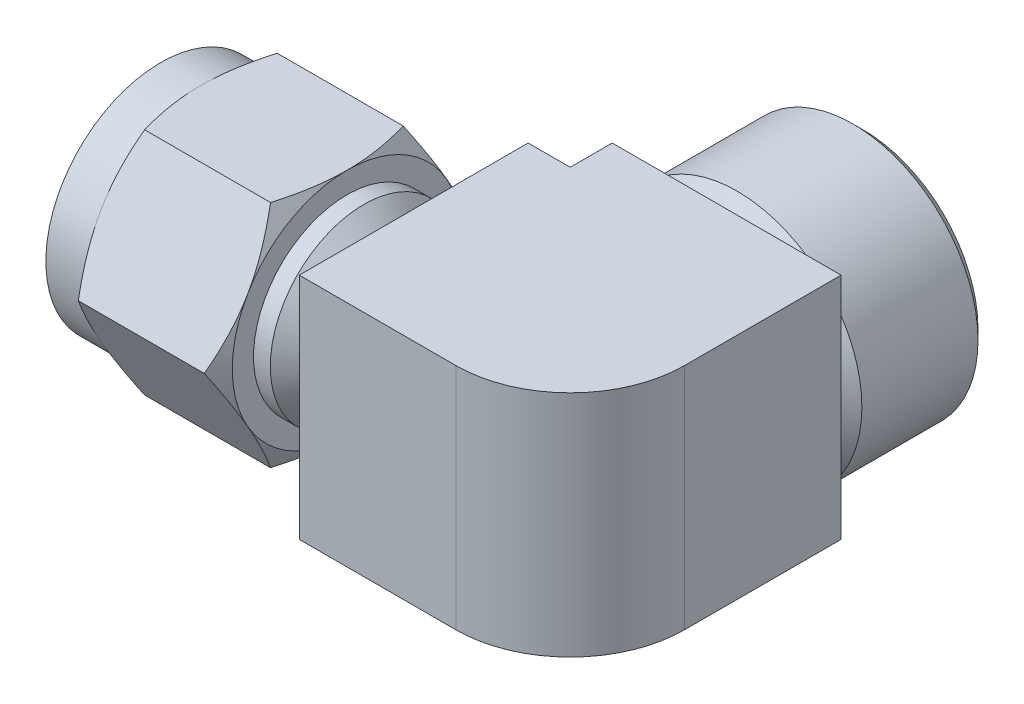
ISO-10303-21;
HEADER;
FILE_DESCRIPTION(('STEP AP214'),'2;1');
FILE_NAME('part.step','',(''),(''),'','','');
FILE_SCHEMA(('AUTOMOTIVE_DESIGN { 1 0 10303 214 1 1 1 1 }'));
ENDSEC;
DATA;
#1=APPLICATION_CONTEXT('core data for automotive mechanical design processes');
#2=APPLICATION_PROTOCOL_DEFINITION('international standard','automotive_design',2000,#1);
#3=PRODUCT_CONTEXT('',#1,'mechanical');
#4=PRODUCT('Part','Part','',(#3));
#5=PRODUCT_RELATED_PRODUCT_CATEGORY('part','',(#4));
#6=PRODUCT_DEFINITION_FORMATION('','',#4);
#7=PRODUCT_DEFINITION_CONTEXT('part definition',#1,'design');
#8=PRODUCT_DEFINITION('design','',#6,#7);
#9=PRODUCT_DEFINITION_SHAPE('','',#8);
#10=(LENGTH_UNIT() NAMED_UNIT(*) SI_UNIT(.MILLI.,.METRE.));
#11=(NAMED_UNIT(*) PLANE_ANGLE_UNIT() SI_UNIT($,.RADIAN.));
#12=(NAMED_UNIT(*) SI_UNIT($,.STERADIAN.) SOLID_ANGLE_UNIT());
#13=UNCERTAINTY_MEASURE_WITH_UNIT(LENGTH_MEASURE(1.E-05),#10,'distance_accuracy_value','');
#14=(GEOMETRIC_REPRESENTATION_CONTEXT(3) GLOBAL_UNCERTAINTY_ASSIGNED_CONTEXT((#13)) GLOBAL_UNIT_ASSIGNED_CONTEXT((#10,
#11,#12)) REPRESENTATION_CONTEXT('',''));
#15=CARTESIAN_POINT('',(0.,0.,0.));
#16=DIRECTION('',(0.,0.,1.));
#17=DIRECTION('',(1.,0.,0.));
#18=AXIS2_PLACEMENT_3D('',#15,#16,#17);
#19=CARTESIAN_POINT('',(8.382,0.,0.));
#20=DIRECTION('',(1.,0.,0.));
#21=DIRECTION('',(0.,0.,-1.));
#22=AXIS2_PLACEMENT_3D('',#19,#20,#21);
#23=CYLINDRICAL_SURFACE('',#22,4.7625);
#24=CARTESIAN_POINT('',(0.,0.,0.));
#25=DIRECTION('',(1.,0.,0.));
#26=DIRECTION('',(0.,0.,-1.));
#27=AXIS2_PLACEMENT_3D('',#24,#25,#26);
#28=CIRCLE('',#27,4.7625);
#29=CARTESIAN_POINT('',(0.,0.,-4.7625));
#30=VERTEX_POINT('',#29);
#31=EDGE_CURVE('E198',#30,#30,#28,.T.);
#32=ORIENTED_EDGE('',*,*,#31,.F.);
#33=EDGE_LOOP('',(#32));
#34=FACE_BOUND('',#33,.T.);
#35=CARTESIAN_POINT('',(16.764,0.,0.));
#36=DIRECTION('',(1.,0.,0.));
#37=DIRECTION('',(0.,0.,-1.));
#38=AXIS2_PLACEMENT_3D('',#35,#36,#37);
#39=CIRCLE('',#38,4.7625);
#40=CARTESIAN_POINT('',(16.764,0.,-4.7625));
#41=VERTEX_POINT('',#40);
#42=EDGE_CURVE('E19',#41,#41,#39,.T.);
#43=ORIENTED_EDGE('',*,*,#42,.T.);
#44=EDGE_LOOP('',(#43));
#45=FACE_BOUND('',#44,.T.);
#46=ADVANCED_FACE('F16',(#34,#45),#23,.F.);
#47=CARTESIAN_POINT('',(16.764,0.,0.));
#48=DIRECTION('',(1.,0.,0.));
#49=DIRECTION('',(0.,1.,0.));
#50=AXIS2_PLACEMENT_3D('',#47,#48,#49);
#51=PLANE('',#50);
#52=ORIENTED_EDGE('',*,*,#42,.F.);
#53=EDGE_LOOP('',(#52));
#54=FACE_BOUND('',#53,.T.);
#55=CARTESIAN_POINT('',(16.764,0.,0.));
#56=DIRECTION('',(1.,0.,0.));
#57=DIRECTION('',(0.,0.,-1.));
#58=AXIS2_PLACEMENT_3D('',#55,#56,#57);
#59=CIRCLE('',#58,3.556);
#60=CARTESIAN_POINT('',(16.764,0.,-3.556));
#61=VERTEX_POINT('',#60);
#62=EDGE_CURVE('E174',#61,#61,#59,.T.);
#63=ORIENTED_EDGE('',*,*,#62,.T.);
#64=EDGE_LOOP('',(#63));
#65=FACE_BOUND('',#64,.T.);
#66=ADVANCED_FACE('F206',(#54,#65),#51,.F.);
#67=CARTESIAN_POINT('',(0.,0.,4.3815));
#68=DIRECTION('',(-1.,0.,0.));
#69=DIRECTION('',(0.,0.,1.));
#70=AXIS2_PLACEMENT_3D('',#67,#68,#69);
#71=PLANE('',#70);
#72=CARTESIAN_POINT('',(0.,0.,0.));
#73=DIRECTION('',(1.,0.,0.));
#74=DIRECTION('',(0.,0.,-1.));
#75=AXIS2_PLACEMENT_3D('',#72,#73,#74);
#76=CIRCLE('',#75,8.763);
#77=CARTESIAN_POINT('',(0.,0.,-8.763));
#78=VERTEX_POINT('',#77);
#79=EDGE_CURVE('E173',#78,#78,#76,.T.);
#80=ORIENTED_EDGE('',*,*,#79,.F.);
#81=EDGE_LOOP('',(#80));
#82=FACE_BOUND('',#81,.T.);
#83=ORIENTED_EDGE('',*,*,#31,.T.);
#84=EDGE_LOOP('',(#83));
#85=FACE_BOUND('',#84,.T.);
#86=ADVANCED_FACE('F209',(#82,#85),#71,.T.);
#87=CARTESIAN_POINT('',(25.273,0.,0.));
#88=DIRECTION('',(1.,0.,0.));
#89=DIRECTION('',(0.,0.,-1.));
#90=AXIS2_PLACEMENT_3D('',#87,#88,#89);
#91=CYLINDRICAL_SURFACE('',#90,3.556);
#92=CARTESIAN_POINT('',(31.242,0.,0.));
#93=DIRECTION('',(1.,0.,0.));
#94=DIRECTION('',(0.,0.,-1.));
#95=AXIS2_PLACEMENT_3D('',#92,#93,#94);
#96=CIRCLE('',#95,3.556);
#97=CARTESIAN_POINT('',(31.242,3.556,0.));
#98=VERTEX_POINT('',#97);
#99=CARTESIAN_POINT('',(31.242,-3.556,0.));
#100=VERTEX_POINT('',#99);
#101=EDGE_CURVE('E165',#98,#100,#96,.T.);
#102=ORIENTED_EDGE('',*,*,#101,.T.);
#103=CARTESIAN_POINT('',(31.242,0.,0.));
#104=DIRECTION('',(0.707106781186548,0.,-0.707106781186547));
#105=DIRECTION('',(0.707106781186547,0.,0.707106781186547));
#106=AXIS2_PLACEMENT_3D('',#103,#104,#105);
#107=ELLIPSE('',#106,5.02894342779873,3.556);
#108=EDGE_CURVE('E172',#100,#98,#107,.T.);
#109=ORIENTED_EDGE('',*,*,#108,.T.);
#110=EDGE_LOOP('',(#102,#109));
#111=FACE_BOUND('',#110,.T.);
#112=ORIENTED_EDGE('',*,*,#62,.F.);
#113=EDGE_LOOP('',(#112));
#114=FACE_BOUND('',#113,.T.);
#115=ADVANCED_FACE('F170',(#111,#114),#91,.F.);
#116=CARTESIAN_POINT('',(31.242,0.,0.));
#117=DIRECTION('',(0.36016930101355,0.698842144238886,0.617978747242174));
#118=DIRECTION('',(-0.87863866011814,0.476722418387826,-0.0270155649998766));
#119=AXIS2_PLACEMENT_3D('',#116,#117,#118);
#120=SPHERICAL_SURFACE('',#119,3.556);
#121=CARTESIAN_POINT('',(32.5227620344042,2.48508266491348,2.19753242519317));
#122=VERTEX_POINT('',#121);
#123=VERTEX_LOOP('',#122);
#124=FACE_BOUND('',#123,.T.);
#125=ORIENTED_EDGE('',*,*,#101,.F.);
#126=CARTESIAN_POINT('',(31.242,0.,0.));
#127=DIRECTION('',(0.,0.,1.));
#128=DIRECTION('',(1.,0.,0.));
#129=AXIS2_PLACEMENT_3D('',#126,#127,#128);
#130=CIRCLE('',#129,3.556);
#131=EDGE_CURVE('E179',#98,#100,#130,.F.);
#132=ORIENTED_EDGE('',*,*,#131,.T.);
#133=EDGE_LOOP('',(#125,#132));
#134=FACE_BOUND('',#133,.T.);
#135=ADVANCED_FACE('F181',(#124,#134),#120,.F.);
#136=CARTESIAN_POINT('',(8.636,0.,0.));
#137=DIRECTION('',(1.,0.,0.));
#138=DIRECTION('',(0.,0.,-1.));
#139=AXIS2_PLACEMENT_3D('',#136,#137,#138);
#140=CYLINDRICAL_SURFACE('',#139,8.763);
#141=CARTESIAN_POINT('',(3.048,0.,0.));
#142=DIRECTION('',(1.,0.,0.));
#143=DIRECTION('',(0.,0.,-1.));
#144=AXIS2_PLACEMENT_3D('',#141,#142,#143);
#145=CIRCLE('',#144,8.763);
#146=CARTESIAN_POINT('',(3.048,-8.763,0.));
#147=VERTEX_POINT('',#146);
#148=CARTESIAN_POINT('',(3.048,-4.3815,7.58898061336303));
#149=VERTEX_POINT('',#148);
#150=EDGE_CURVE('E182',#147,#149,#145,.F.);
#151=ORIENTED_EDGE('',*,*,#150,.T.);
#152=CARTESIAN_POINT('',(3.048,0.,0.));
#153=DIRECTION('',(1.,0.,0.));
#154=DIRECTION('',(0.,0.,-1.));
#155=AXIS2_PLACEMENT_3D('',#152,#153,#154);
#156=CIRCLE('',#155,8.763);
#157=CARTESIAN_POINT('',(3.048,4.3815,7.58898061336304));
#158=VERTEX_POINT('',#157);
#159=EDGE_CURVE('E439',#149,#158,#156,.F.);
#160=ORIENTED_EDGE('',*,*,#159,.T.);
#161=CARTESIAN_POINT('',(3.048,0.,0.));
#162=DIRECTION('',(1.,0.,0.));
#163=DIRECTION('',(0.,0.,-1.));
#164=AXIS2_PLACEMENT_3D('',#161,#162,#163);
#165=CIRCLE('',#164,8.763);
#166=CARTESIAN_POINT('',(3.048,8.763,0.));
#167=VERTEX_POINT('',#166);
#168=EDGE_CURVE('E436',#158,#167,#165,.F.);
#169=ORIENTED_EDGE('',*,*,#168,.T.);
#170=CARTESIAN_POINT('',(3.048,0.,0.));
#171=DIRECTION('',(1.,0.,0.));
#172=DIRECTION('',(0.,0.,-1.));
#173=AXIS2_PLACEMENT_3D('',#170,#171,#172);
#174=CIRCLE('',#173,8.763);
#175=CARTESIAN_POINT('',(3.048,4.3815,-7.58898061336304));
#176=VERTEX_POINT('',#175);
#177=EDGE_CURVE('E433',#167,#176,#174,.F.);
#178=ORIENTED_EDGE('',*,*,#177,.T.);
#179=CARTESIAN_POINT('',(3.048,0.,0.));
#180=DIRECTION('',(1.,0.,0.));
#181=DIRECTION('',(0.,0.,-1.));
#182=AXIS2_PLACEMENT_3D('',#179,#180,#181);
#183=CIRCLE('',#182,8.763);
#184=CARTESIAN_POINT('',(3.048,-4.3815,-7.58898061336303));
#185=VERTEX_POINT('',#184);
#186=EDGE_CURVE('E442',#176,#185,#183,.F.);
#187=ORIENTED_EDGE('',*,*,#186,.T.);
#188=CARTESIAN_POINT('',(3.048,0.,0.));
#189=DIRECTION('',(1.,0.,0.));
#190=DIRECTION('',(0.,0.,-1.));
#191=AXIS2_PLACEMENT_3D('',#188,#189,#190);
#192=CIRCLE('',#191,8.763);
#193=EDGE_CURVE('E185',#185,#147,#192,.F.);
#194=ORIENTED_EDGE('',*,*,#193,.T.);
#195=EDGE_LOOP('',(#151,#160,#169,#178,#187,#194));
#196=FACE_BOUND('',#195,.T.);
#197=ORIENTED_EDGE('',*,*,#79,.T.);
#198=EDGE_LOOP('',(#197));
#199=FACE_BOUND('',#198,.T.);
#200=ADVANCED_FACE('F218',(#196,#199),#140,.T.);
#201=CARTESIAN_POINT('',(31.242,0.,-11.176));
#202=DIRECTION('',(0.,0.,1.));
#203=DIRECTION('',(1.,0.,0.));
#204=AXIS2_PLACEMENT_3D('',#201,#202,#203);
#205=CYLINDRICAL_SURFACE('',#204,3.556);
#206=ORIENTED_EDGE('',*,*,#108,.F.);
#207=ORIENTED_EDGE('',*,*,#131,.F.);
#208=EDGE_LOOP('',(#206,#207));
#209=FACE_BOUND('',#208,.T.);
#210=CARTESIAN_POINT('',(31.242,0.,-12.3317));
#211=DIRECTION('',(0.,0.,1.));
#212=DIRECTION('',(1.,0.,0.));
#213=AXIS2_PLACEMENT_3D('',#210,#211,#212);
#214=CIRCLE('',#213,3.556);
#215=CARTESIAN_POINT('',(34.798,0.,-12.3317));
#216=VERTEX_POINT('',#215);
#217=EDGE_CURVE('E189',#216,#216,#214,.F.);
#218=ORIENTED_EDGE('',*,*,#217,.T.);
#219=EDGE_LOOP('',(#218));
#220=FACE_BOUND('',#219,.T.);
#221=ADVANCED_FACE('F177',(#209,#220),#205,.F.);
#222=CARTESIAN_POINT('',(3.048,0.,0.));
#223=DIRECTION('',(1.,0.,0.));
#224=DIRECTION('',(0.,0.,-1.));
#225=AXIS2_PLACEMENT_3D('',#222,#223,#224);
#226=CONICAL_SURFACE('',#225,8.763,1.0471975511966);
#227=CARTESIAN_POINT('',(3.048,-4.3815,7.58898061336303));
#228=CARTESIAN_POINT('',(3.04796418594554,-4.56747009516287,7.48161072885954));
#229=CARTESIAN_POINT('',(3.05255639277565,-4.75343123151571,7.37424601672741));
#230=CARTESIAN_POINT('',(3.07073065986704,-5.12498836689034,7.15972740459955));
#231=CARTESIAN_POINT('',(3.08431094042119,-5.31058443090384,7.05257346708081));
#232=CARTESIAN_POINT('',(3.12010574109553,-5.68021261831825,6.83916853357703));
#233=CARTESIAN_POINT('',(3.14227679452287,-5.86424792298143,6.73291570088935));
#234=CARTESIAN_POINT('',(3.19477623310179,-6.23144172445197,6.52091626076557));
#235=CARTESIAN_POINT('',(3.2251048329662,-6.4146001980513,6.41516966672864));
#236=CARTESIAN_POINT('',(3.32739002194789,-6.96200116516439,6.09912757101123));
#237=CARTESIAN_POINT('',(3.41069566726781,-7.324653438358,5.88975018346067));
#238=CARTESIAN_POINT('',(3.60281979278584,-8.04683933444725,5.47279596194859));
#239=CARTESIAN_POINT('',(3.7117656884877,-8.40634776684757,5.26523367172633));
#240=CARTESIAN_POINT('',(3.83067959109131,-8.763,5.05932040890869));
#241=B_SPLINE_CURVE_WITH_KNOTS('',3,(#227,#228,#229,#230,#231,#232,#233,#234,#235,#236,#237,
#238,#239,#240),.UNSPECIFIED.,.F.,.F.,(4,2,2,2,2,2,4),(0.,0.644153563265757,1.28817961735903,
1.92898877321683,2.5698147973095,3.84978725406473,5.13625990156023),.UNSPECIFIED.);
#242=CARTESIAN_POINT('',(3.83067959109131,-8.763,5.05932040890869));
#243=VERTEX_POINT('',#242);
#244=EDGE_CURVE('E478',#149,#243,#241,.T.);
#245=ORIENTED_EDGE('',*,*,#244,.F.);
#246=ORIENTED_EDGE('',*,*,#150,.F.);
#247=CARTESIAN_POINT('',(3.83067959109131,-8.763,5.05932040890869));
#248=CARTESIAN_POINT('',(3.7117656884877,-8.763,4.64749388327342));
#249=CARTESIAN_POINT('',(3.60281979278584,-8.763,4.23236930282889));
#250=CARTESIAN_POINT('',(3.41069566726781,-8.763,3.39846085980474));
#251=CARTESIAN_POINT('',(3.32739002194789,-8.763,2.97970608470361));
#252=CARTESIAN_POINT('',(3.2251048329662,-8.763,2.3476218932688));
#253=CARTESIAN_POINT('',(3.19477623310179,-8.763,2.13612870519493));
#254=CARTESIAN_POINT('',(3.14227679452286,-8.763,1.71212982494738));
#255=CARTESIAN_POINT('',(3.12010574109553,-8.763,1.49962415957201));
#256=CARTESIAN_POINT('',(3.08431094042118,-8.763,1.07281429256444));
#257=CARTESIAN_POINT('',(3.07073065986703,-8.76299999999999,0.858506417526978));
#258=CARTESIAN_POINT('',(3.05255639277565,-8.76299999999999,0.429469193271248));
#259=CARTESIAN_POINT('',(3.04796418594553,-8.76299999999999,0.214739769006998));
#260=CARTESIAN_POINT('',(3.048,-8.76299999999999,0.));
#261=B_SPLINE_CURVE_WITH_KNOTS('',3,(#247,#248,#249,#250,#251,#252,#253,#254,#255,#256,#257,
#258,#259,#260),.UNSPECIFIED.,.F.,.F.,(4,2,2,2,2,2,4),(0.,1.2864726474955,2.56644510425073,
3.2072711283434,3.8480802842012,4.49210633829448,5.13625990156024),.UNSPECIFIED.);
#262=EDGE_CURVE('E431',#243,#147,#261,.T.);
#263=ORIENTED_EDGE('',*,*,#262,.F.);
#264=EDGE_LOOP('',(#245,#246,#263));
#265=FACE_BOUND('',#264,.T.);
#266=ADVANCED_FACE('F461',(#265),#226,.T.);
#267=CARTESIAN_POINT('',(3.048,0.,0.));
#268=DIRECTION('',(1.,0.,0.));
#269=DIRECTION('',(0.,0.,-1.));
#270=AXIS2_PLACEMENT_3D('',#267,#268,#269);
#271=CONICAL_SURFACE('',#270,8.763,1.0471975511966);
#272=ORIENTED_EDGE('',*,*,#193,.F.);
#273=CARTESIAN_POINT('',(3.83067959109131,-8.763,-5.05932040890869));
#274=CARTESIAN_POINT('',(3.7117656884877,-8.40634776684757,-5.26523367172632));
#275=CARTESIAN_POINT('',(3.60281979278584,-8.04683933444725,-5.47279596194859));
#276=CARTESIAN_POINT('',(3.41069566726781,-7.324653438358,-5.88975018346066));
#277=CARTESIAN_POINT('',(3.32739002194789,-6.96200116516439,-6.09912757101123));
#278=CARTESIAN_POINT('',(3.2251048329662,-6.4146001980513,-6.41516966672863));
#279=CARTESIAN_POINT('',(3.19477623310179,-6.23144172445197,-6.52091626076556));
#280=CARTESIAN_POINT('',(3.14227679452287,-5.86424792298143,-6.73291570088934));
#281=CARTESIAN_POINT('',(3.12010574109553,-5.68021261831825,-6.83916853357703));
#282=CARTESIAN_POINT('',(3.08431094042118,-5.31058443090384,-7.05257346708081));
#283=CARTESIAN_POINT('',(3.07073065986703,-5.12498836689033,-7.15972740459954));
#284=CARTESIAN_POINT('',(3.05255639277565,-4.75343123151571,-7.37424601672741));
#285=CARTESIAN_POINT('',(3.04796418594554,-4.56747009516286,-7.48161072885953));
#286=CARTESIAN_POINT('',(3.048,-4.3815,-7.58898061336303));
#287=B_SPLINE_CURVE_WITH_KNOTS('',3,(#273,#274,#275,#276,#277,#278,#279,#280,#281,#282,#283,
#284,#285,#286),.UNSPECIFIED.,.F.,.F.,(4,2,2,2,2,2,4),(0.,1.2864726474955,2.56644510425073,
3.2072711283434,3.8480802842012,4.49210633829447,5.13625990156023),.UNSPECIFIED.);
#288=CARTESIAN_POINT('',(3.83067959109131,-8.76299999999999,-5.05932040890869));
#289=VERTEX_POINT('',#288);
#290=EDGE_CURVE('E755',#289,#185,#287,.T.);
#291=ORIENTED_EDGE('',*,*,#290,.F.);
#292=CARTESIAN_POINT('',(3.048,-8.76299999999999,0.));
#293=CARTESIAN_POINT('',(3.04796418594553,-8.76299999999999,-0.214739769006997));
#294=CARTESIAN_POINT('',(3.05255639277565,-8.76299999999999,-0.429469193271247));
#295=CARTESIAN_POINT('',(3.07073065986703,-8.76299999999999,-0.858506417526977));
#296=CARTESIAN_POINT('',(3.08431094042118,-8.76299999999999,-1.07281429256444));
#297=CARTESIAN_POINT('',(3.12010574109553,-8.76299999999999,-1.49962415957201));
#298=CARTESIAN_POINT('',(3.14227679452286,-8.76299999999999,-1.71212982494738));
#299=CARTESIAN_POINT('',(3.19477623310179,-8.76299999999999,-2.13612870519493));
#300=CARTESIAN_POINT('',(3.2251048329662,-8.76299999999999,-2.34762189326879));
#301=CARTESIAN_POINT('',(3.32739002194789,-8.76299999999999,-2.9797060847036));
#302=CARTESIAN_POINT('',(3.41069566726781,-8.76299999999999,-3.39846085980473));
#303=CARTESIAN_POINT('',(3.60281979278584,-8.76299999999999,-4.23236930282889));
#304=CARTESIAN_POINT('',(3.7117656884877,-8.76299999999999,-4.64749388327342));
#305=CARTESIAN_POINT('',(3.83067959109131,-8.76299999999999,-5.05932040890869));
#306=B_SPLINE_CURVE_WITH_KNOTS('',3,(#292,#293,#294,#295,#296,#297,#298,#299,#300,#301,#302,
#303,#304,#305),.UNSPECIFIED.,.F.,.F.,(4,2,2,2,2,2,4),(0.,0.644153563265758,1.28817961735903,
1.92898877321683,2.56981479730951,3.84978725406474,5.13625990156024),.UNSPECIFIED.);
#307=EDGE_CURVE('E432',#147,#289,#306,.T.);
#308=ORIENTED_EDGE('',*,*,#307,.F.);
#309=EDGE_LOOP('',(#272,#291,#308));
#310=FACE_BOUND('',#309,.T.);
#311=ADVANCED_FACE('F465',(#310),#271,.T.);
#312=CARTESIAN_POINT('',(3.048,0.,0.));
#313=DIRECTION('',(1.,0.,0.));
#314=DIRECTION('',(0.,0.,-1.));
#315=AXIS2_PLACEMENT_3D('',#312,#313,#314);
#316=CONICAL_SURFACE('',#315,8.763,1.0471975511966);
#317=ORIENTED_EDGE('',*,*,#186,.F.);
#318=CARTESIAN_POINT('',(3.83067959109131,0.,-10.1186408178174));
#319=CARTESIAN_POINT('',(3.7117656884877,0.356652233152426,-9.91272755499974));
#320=CARTESIAN_POINT('',(3.60281979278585,0.716160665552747,-9.70516526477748));
#321=CARTESIAN_POINT('',(3.41069566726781,1.43834656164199,-9.2882110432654));
#322=CARTESIAN_POINT('',(3.32739002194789,1.80099883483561,-9.07883365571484));
#323=CARTESIAN_POINT('',(3.22510483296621,2.3483998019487,-8.76279155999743));
#324=CARTESIAN_POINT('',(3.19477623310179,2.53155827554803,-8.6570449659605));
#325=CARTESIAN_POINT('',(3.14227679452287,2.89875207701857,-8.44504552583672));
#326=CARTESIAN_POINT('',(3.12010574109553,3.08278738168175,-8.33879269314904));
#327=CARTESIAN_POINT('',(3.08431094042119,3.45241556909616,-8.12538775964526));
#328=CARTESIAN_POINT('',(3.07073065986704,3.63801163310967,-8.01823382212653));
#329=CARTESIAN_POINT('',(3.05255639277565,4.00956876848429,-7.80371520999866));
#330=CARTESIAN_POINT('',(3.04796418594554,4.19552990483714,-7.69635049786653));
#331=CARTESIAN_POINT('',(3.048,4.3815,-7.58898061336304));
#332=B_SPLINE_CURVE_WITH_KNOTS('',3,(#318,#319,#320,#321,#322,#323,#324,#325,#326,#327,#328,
#329,#330,#331),.UNSPECIFIED.,.F.,.F.,(4,2,2,2,2,2,4),(0.,1.2864726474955,2.56644510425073,
3.2072711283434,3.8480802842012,4.49210633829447,5.13625990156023),.UNSPECIFIED.);
#333=CARTESIAN_POINT('',(3.83067959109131,0.,-10.1186408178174));
#334=VERTEX_POINT('',#333);
#335=EDGE_CURVE('E426',#334,#176,#332,.T.);
#336=ORIENTED_EDGE('',*,*,#335,.F.);
#337=CARTESIAN_POINT('',(3.048,-4.3815,-7.58898061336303));
#338=CARTESIAN_POINT('',(3.04796418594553,-4.19552990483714,-7.69635049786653));
#339=CARTESIAN_POINT('',(3.05255639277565,-4.00956876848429,-7.80371520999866));
#340=CARTESIAN_POINT('',(3.07073065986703,-3.63801163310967,-8.01823382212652));
#341=CARTESIAN_POINT('',(3.08431094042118,-3.45241556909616,-8.12538775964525));
#342=CARTESIAN_POINT('',(3.12010574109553,-3.08278738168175,-8.33879269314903));
#343=CARTESIAN_POINT('',(3.14227679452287,-2.89875207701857,-8.44504552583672));
#344=CARTESIAN_POINT('',(3.19477623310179,-2.53155827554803,-8.6570449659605));
#345=CARTESIAN_POINT('',(3.2251048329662,-2.3483998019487,-8.76279155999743));
#346=CARTESIAN_POINT('',(3.32739002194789,-1.80099883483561,-9.07883365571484));
#347=CARTESIAN_POINT('',(3.41069566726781,-1.438346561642,-9.2882110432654));
#348=CARTESIAN_POINT('',(3.60281979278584,-0.716160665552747,-9.70516526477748));
#349=CARTESIAN_POINT('',(3.7117656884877,-0.356652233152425,-9.91272755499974));
#350=CARTESIAN_POINT('',(3.83067959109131,0.,-10.1186408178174));
#351=B_SPLINE_CURVE_WITH_KNOTS('',3,(#337,#338,#339,#340,#341,#342,#343,#344,#345,#346,#347,
#348,#349,#350),.UNSPECIFIED.,.F.,.F.,(4,2,2,2,2,2,4),(0.,0.644153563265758,1.28817961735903,
1.92898877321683,2.56981479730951,3.84978725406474,5.13625990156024),.UNSPECIFIED.);
#352=EDGE_CURVE('E427',#185,#334,#351,.T.);
#353=ORIENTED_EDGE('',*,*,#352,.F.);
#354=EDGE_LOOP('',(#317,#336,#353));
#355=FACE_BOUND('',#354,.T.);
#356=ADVANCED_FACE('F808',(#355),#316,.T.);
#357=CARTESIAN_POINT('',(3.048,0.,0.));
#358=DIRECTION('',(1.,0.,0.));
#359=DIRECTION('',(0.,0.,-1.));
#360=AXIS2_PLACEMENT_3D('',#357,#358,#359);
#361=CONICAL_SURFACE('',#360,8.763,1.0471975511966);
#362=CARTESIAN_POINT('',(3.048,4.3815,7.58898061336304));
#363=CARTESIAN_POINT('',(3.04796418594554,4.19552990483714,7.69635049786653));
#364=CARTESIAN_POINT('',(3.05255639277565,4.00956876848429,7.80371520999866));
#365=CARTESIAN_POINT('',(3.07073065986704,3.63801163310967,8.01823382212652));
#366=CARTESIAN_POINT('',(3.08431094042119,3.45241556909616,8.12538775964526));
#367=CARTESIAN_POINT('',(3.12010574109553,3.08278738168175,8.33879269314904));
#368=CARTESIAN_POINT('',(3.14227679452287,2.89875207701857,8.44504552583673));
#369=CARTESIAN_POINT('',(3.19477623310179,2.53155827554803,8.6570449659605));
#370=CARTESIAN_POINT('',(3.22510483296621,2.3483998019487,8.76279155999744));
#371=CARTESIAN_POINT('',(3.32739002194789,1.80099883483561,9.07883365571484));
#372=CARTESIAN_POINT('',(3.41069566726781,1.43834656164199,9.2882110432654));
#373=CARTESIAN_POINT('',(3.60281979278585,0.716160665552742,9.70516526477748));
#374=CARTESIAN_POINT('',(3.7117656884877,0.356652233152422,9.91272755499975));
#375=CARTESIAN_POINT('',(3.83067959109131,0.,10.1186408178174));
#376=B_SPLINE_CURVE_WITH_KNOTS('',3,(#362,#363,#364,#365,#366,#367,#368,#369,#370,#371,#372,
#373,#374,#375),.UNSPECIFIED.,.F.,.F.,(4,2,2,2,2,2,4),(0.,0.64415356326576,1.28817961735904,
1.92898877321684,2.56981479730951,3.84978725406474,5.13625990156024),.UNSPECIFIED.);
#377=CARTESIAN_POINT('',(3.83067959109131,0.,10.1186408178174));
#378=VERTEX_POINT('',#377);
#379=EDGE_CURVE('E418',#158,#378,#376,.T.);
#380=ORIENTED_EDGE('',*,*,#379,.F.);
#381=ORIENTED_EDGE('',*,*,#159,.F.);
#382=CARTESIAN_POINT('',(3.83067959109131,0.,10.1186408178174));
#383=CARTESIAN_POINT('',(3.7117656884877,-0.35665223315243,9.91272755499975));
#384=CARTESIAN_POINT('',(3.60281979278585,-0.716160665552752,9.70516526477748));
#385=CARTESIAN_POINT('',(3.41069566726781,-1.438346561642,9.2882110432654));
#386=CARTESIAN_POINT('',(3.32739002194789,-1.80099883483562,9.07883365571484));
#387=CARTESIAN_POINT('',(3.22510483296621,-2.34839980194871,8.76279155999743));
#388=CARTESIAN_POINT('',(3.19477623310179,-2.53155827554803,8.6570449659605));
#389=CARTESIAN_POINT('',(3.14227679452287,-2.89875207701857,8.44504552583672));
#390=CARTESIAN_POINT('',(3.12010574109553,-3.08278738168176,8.33879269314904));
#391=CARTESIAN_POINT('',(3.08431094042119,-3.45241556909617,8.12538775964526));
#392=CARTESIAN_POINT('',(3.07073065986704,-3.63801163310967,8.01823382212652));
#393=CARTESIAN_POINT('',(3.05255639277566,-4.00956876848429,7.80371520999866));
#394=CARTESIAN_POINT('',(3.04796418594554,-4.19552990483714,7.69635049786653));
#395=CARTESIAN_POINT('',(3.048,-4.3815,7.58898061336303));
#396=B_SPLINE_CURVE_WITH_KNOTS('',3,(#382,#383,#384,#385,#386,#387,#388,#389,#390,#391,#392,
#393,#394,#395),.UNSPECIFIED.,.F.,.F.,(4,2,2,2,2,2,4),(0.,1.2864726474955,2.56644510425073,
3.2072711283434,3.8480802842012,4.49210633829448,5.13625990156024),.UNSPECIFIED.);
#397=EDGE_CURVE('E482',#378,#149,#396,.T.);
#398=ORIENTED_EDGE('',*,*,#397,.F.);
#399=EDGE_LOOP('',(#380,#381,#398));
#400=FACE_BOUND('',#399,.T.);
#401=ADVANCED_FACE('F801',(#400),#361,.T.);
#402=CARTESIAN_POINT('',(3.048,0.,0.));
#403=DIRECTION('',(1.,0.,0.));
#404=DIRECTION('',(0.,0.,-1.));
#405=AXIS2_PLACEMENT_3D('',#402,#403,#404);
#406=CONICAL_SURFACE('',#405,8.763,1.0471975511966);
#407=CARTESIAN_POINT('',(3.048,8.763,0.));
#408=CARTESIAN_POINT('',(3.04796418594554,8.763,0.214739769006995));
#409=CARTESIAN_POINT('',(3.05255639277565,8.763,0.429469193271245));
#410=CARTESIAN_POINT('',(3.07073065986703,8.763,0.858506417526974));
#411=CARTESIAN_POINT('',(3.08431094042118,8.763,1.07281429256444));
#412=CARTESIAN_POINT('',(3.12010574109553,8.763,1.499624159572));
#413=CARTESIAN_POINT('',(3.14227679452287,8.763,1.71212982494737));
#414=CARTESIAN_POINT('',(3.19477623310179,8.763,2.13612870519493));
#415=CARTESIAN_POINT('',(3.2251048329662,8.763,2.34762189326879));
#416=CARTESIAN_POINT('',(3.32739002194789,8.763,2.9797060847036));
#417=CARTESIAN_POINT('',(3.41069566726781,8.763,3.39846085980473));
#418=CARTESIAN_POINT('',(3.60281979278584,8.763,4.23236930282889));
#419=CARTESIAN_POINT('',(3.7117656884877,8.763,4.64749388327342));
#420=CARTESIAN_POINT('',(3.83067959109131,8.763,5.05932040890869));
#421=B_SPLINE_CURVE_WITH_KNOTS('',3,(#407,#408,#409,#410,#411,#412,#413,#414,#415,#416,#417,
#418,#419,#420),.UNSPECIFIED.,.F.,.F.,(4,2,2,2,2,2,4),(0.,0.644153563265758,1.28817961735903,
1.92898877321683,2.56981479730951,3.84978725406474,5.13625990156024),.UNSPECIFIED.);
#422=CARTESIAN_POINT('',(3.83067959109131,8.763,5.05932040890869));
#423=VERTEX_POINT('',#422);
#424=EDGE_CURVE('E415',#167,#423,#421,.T.);
#425=ORIENTED_EDGE('',*,*,#424,.F.);
#426=ORIENTED_EDGE('',*,*,#168,.F.);
#427=CARTESIAN_POINT('',(3.83067959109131,8.763,5.05932040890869));
#428=CARTESIAN_POINT('',(3.7117656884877,8.40634776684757,5.26523367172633));
#429=CARTESIAN_POINT('',(3.60281979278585,8.04683933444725,5.47279596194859));
#430=CARTESIAN_POINT('',(3.41069566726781,7.324653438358,5.88975018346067));
#431=CARTESIAN_POINT('',(3.32739002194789,6.96200116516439,6.09912757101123));
#432=CARTESIAN_POINT('',(3.22510483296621,6.4146001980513,6.41516966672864));
#433=CARTESIAN_POINT('',(3.19477623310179,6.23144172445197,6.52091626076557));
#434=CARTESIAN_POINT('',(3.14227679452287,5.86424792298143,6.73291570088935));
#435=CARTESIAN_POINT('',(3.12010574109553,5.68021261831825,6.83916853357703));
#436=CARTESIAN_POINT('',(3.08431094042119,5.31058443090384,7.05257346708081));
#437=CARTESIAN_POINT('',(3.07073065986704,5.12498836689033,7.15972740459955));
#438=CARTESIAN_POINT('',(3.05255639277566,4.75343123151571,7.37424601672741));
#439=CARTESIAN_POINT('',(3.04796418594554,4.56747009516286,7.48161072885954));
#440=CARTESIAN_POINT('',(3.048,4.3815,7.58898061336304));
#441=B_SPLINE_CURVE_WITH_KNOTS('',3,(#427,#428,#429,#430,#431,#432,#433,#434,#435,#436,#437,
#438,#439,#440),.UNSPECIFIED.,.F.,.F.,(4,2,2,2,2,2,4),(0.,1.2864726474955,2.56644510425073,
3.2072711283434,3.8480802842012,4.49210633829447,5.13625990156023),.UNSPECIFIED.);
#442=EDGE_CURVE('E353',#423,#158,#441,.T.);
#443=ORIENTED_EDGE('',*,*,#442,.F.);
#444=EDGE_LOOP('',(#425,#426,#443));
#445=FACE_BOUND('',#444,.T.);
#446=ADVANCED_FACE('F794',(#445),#406,.T.);
#447=CARTESIAN_POINT('',(3.048,0.,0.));
#448=DIRECTION('',(1.,0.,0.));
#449=DIRECTION('',(0.,0.,-1.));
#450=AXIS2_PLACEMENT_3D('',#447,#448,#449);
#451=CONICAL_SURFACE('',#450,8.763,1.0471975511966);
#452=ORIENTED_EDGE('',*,*,#177,.F.);
#453=CARTESIAN_POINT('',(3.83067959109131,8.763,-5.05932040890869));
#454=CARTESIAN_POINT('',(3.7117656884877,8.763,-4.64749388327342));
#455=CARTESIAN_POINT('',(3.60281979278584,8.763,-4.23236930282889));
#456=CARTESIAN_POINT('',(3.41069566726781,8.763,-3.39846085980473));
#457=CARTESIAN_POINT('',(3.32739002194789,8.763,-2.9797060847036));
#458=CARTESIAN_POINT('',(3.22510483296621,8.763,-2.34762189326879));
#459=CARTESIAN_POINT('',(3.19477623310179,8.763,-2.13612870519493));
#460=CARTESIAN_POINT('',(3.14227679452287,8.763,-1.71212982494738));
#461=CARTESIAN_POINT('',(3.12010574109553,8.763,-1.49962415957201));
#462=CARTESIAN_POINT('',(3.08431094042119,8.763,-1.07281429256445));
#463=CARTESIAN_POINT('',(3.07073065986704,8.763,-0.858506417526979));
#464=CARTESIAN_POINT('',(3.05255639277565,8.763,-0.42946919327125));
#465=CARTESIAN_POINT('',(3.04796418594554,8.763,-0.214739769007));
#466=CARTESIAN_POINT('',(3.048,8.763,0.));
#467=B_SPLINE_CURVE_WITH_KNOTS('',3,(#453,#454,#455,#456,#457,#458,#459,#460,#461,#462,#463,
#464,#465,#466),.UNSPECIFIED.,.F.,.F.,(4,2,2,2,2,2,4),(0.,1.2864726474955,2.56644510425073,
3.2072711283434,3.8480802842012,4.49210633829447,5.13625990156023),.UNSPECIFIED.);
#468=CARTESIAN_POINT('',(3.83067959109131,8.763,-5.05932040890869));
#469=VERTEX_POINT('',#468);
#470=EDGE_CURVE('E412',#469,#167,#467,.T.);
#471=ORIENTED_EDGE('',*,*,#470,.F.);
#472=CARTESIAN_POINT('',(3.048,4.3815,-7.58898061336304));
#473=CARTESIAN_POINT('',(3.04796418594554,4.56747009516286,-7.48161072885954));
#474=CARTESIAN_POINT('',(3.05255639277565,4.75343123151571,-7.37424601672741));
#475=CARTESIAN_POINT('',(3.07073065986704,5.12498836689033,-7.15972740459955));
#476=CARTESIAN_POINT('',(3.08431094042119,5.31058443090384,-7.05257346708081));
#477=CARTESIAN_POINT('',(3.12010574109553,5.68021261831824,-6.83916853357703));
#478=CARTESIAN_POINT('',(3.14227679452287,5.86424792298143,-6.73291570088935));
#479=CARTESIAN_POINT('',(3.19477623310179,6.23144172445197,-6.52091626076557));
#480=CARTESIAN_POINT('',(3.22510483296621,6.4146001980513,-6.41516966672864));
#481=CARTESIAN_POINT('',(3.32739002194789,6.96200116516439,-6.09912757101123));
#482=CARTESIAN_POINT('',(3.41069566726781,7.32465343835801,-5.88975018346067));
#483=CARTESIAN_POINT('',(3.60281979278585,8.04683933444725,-5.47279596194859));
#484=CARTESIAN_POINT('',(3.7117656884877,8.40634776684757,-5.26523367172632));
#485=CARTESIAN_POINT('',(3.83067959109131,8.763,-5.05932040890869));
#486=B_SPLINE_CURVE_WITH_KNOTS('',3,(#472,#473,#474,#475,#476,#477,#478,#479,#480,#481,#482,
#483,#484,#485),.UNSPECIFIED.,.F.,.F.,(4,2,2,2,2,2,4),(0.,0.644153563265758,1.28817961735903,
1.92898877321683,2.56981479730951,3.84978725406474,5.13625990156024),.UNSPECIFIED.);
#487=EDGE_CURVE('E422',#176,#469,#486,.T.);
#488=ORIENTED_EDGE('',*,*,#487,.F.);
#489=EDGE_LOOP('',(#452,#471,#488));
#490=FACE_BOUND('',#489,.T.);
#491=ADVANCED_FACE('F787',(#490),#451,.T.);
#492=CARTESIAN_POINT('',(31.242,0.,-12.3317));
#493=DIRECTION('',(0.,0.,1.));
#494=DIRECTION('',(1.,0.,0.));
#495=AXIS2_PLACEMENT_3D('',#492,#493,#494);
#496=PLANE('',#495);
#497=CARTESIAN_POINT('',(31.242,0.,-12.3317000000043));
#498=DIRECTION('',(0.,0.,-1.));
#499=DIRECTION('',(-1.,0.,0.));
#500=AXIS2_PLACEMENT_3D('',#497,#498,#499);
#501=CIRCLE('',#500,5.45113896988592);
#502=CARTESIAN_POINT('',(25.7908610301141,0.,-12.3317000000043));
#503=VERTEX_POINT('',#502);
#504=EDGE_CURVE('E371',#503,#503,#501,.T.);
#505=ORIENTED_EDGE('',*,*,#504,.T.);
#506=EDGE_LOOP('',(#505));
#507=FACE_BOUND('',#506,.T.);
#508=ORIENTED_EDGE('',*,*,#217,.F.);
#509=EDGE_LOOP('',(#508));
#510=FACE_BOUND('',#509,.T.);
#511=ADVANCED_FACE('F495',(#507,#510),#496,.F.);
#512=CARTESIAN_POINT('',(14.224,0.,10.1186408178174));
#513=DIRECTION('',(0.,-0.5,0.866025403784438));
#514=DIRECTION('',(0.,-0.866025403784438,-0.5));
#515=AXIS2_PLACEMENT_3D('',#512,#513,#514);
#516=PLANE('',#515);
#517=CARTESIAN_POINT('',(14.224,-4.38150000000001,7.58898061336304));
#518=CARTESIAN_POINT('',(14.2240358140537,-4.19552990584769,7.69635049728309));
#519=CARTESIAN_POINT('',(14.2194436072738,-4.00956877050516,7.80371520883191));
#520=CARTESIAN_POINT('',(14.2012693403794,-3.6380116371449,8.01823381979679));
#521=CARTESIAN_POINT('',(14.1876890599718,-3.45241557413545,8.12538775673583));
#522=CARTESIAN_POINT('',(14.1518942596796,-3.08278738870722,8.33879268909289));
#523=CARTESIAN_POINT('',(14.129723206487,-2.89875208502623,8.4450455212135));
#524=CARTESIAN_POINT('',(14.0772237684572,-2.53155828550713,8.65704496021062));
#525=CARTESIAN_POINT('',(14.046895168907,-2.34839981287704,8.76279155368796));
#526=CARTESIAN_POINT('',(13.944609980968,-1.80099884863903,9.07883364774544));
#527=CARTESIAN_POINT('',(13.8613043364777,-1.43834657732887,9.28821103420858));
#528=CARTESIAN_POINT('',(13.6691802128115,-0.716160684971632,9.70516525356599));
#529=CARTESIAN_POINT('',(13.5602343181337,-0.356652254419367,9.91272754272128));
#530=CARTESIAN_POINT('',(13.4413204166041,-2.30861681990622E-08,10.1186408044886));
#531=B_SPLINE_CURVE_WITH_KNOTS('',3,(#517,#518,#519,#520,#521,#522,#523,#524,#525,#526,#527,
#528,#529,#530),.UNSPECIFIED.,.F.,.F.,(4,2,2,2,2,2,4),(0.,0.644153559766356,1.28817961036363,
1.92898876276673,2.56981478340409,3.84978723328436,5.1362598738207),.UNSPECIFIED.);
#532=CARTESIAN_POINT('',(14.224,-4.3815,7.58898061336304));
#533=VERTEX_POINT('',#532);
#534=CARTESIAN_POINT('',(13.4413204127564,1.15430780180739E-08,10.118640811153));
#535=VERTEX_POINT('',#534);
#536=EDGE_CURVE('E370',#533,#535,#531,.T.);
#537=ORIENTED_EDGE('',*,*,#536,.T.);
#538=DIRECTION('',(1.,0.,0.));
#539=VECTOR('',#538,1.);
#540=CARTESIAN_POINT('',(14.224,0.,10.1186408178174));
#541=LINE('',#540,#539);
#542=EDGE_CURVE('E416',#378,#535,#541,.T.);
#543=ORIENTED_EDGE('',*,*,#542,.F.);
#544=ORIENTED_EDGE('',*,*,#397,.T.);
#545=ORIENTED_EDGE('',*,*,#244,.T.);
#546=DIRECTION('',(1.,0.,0.));
#547=VECTOR('',#546,1.);
#548=CARTESIAN_POINT('',(14.224,-8.763,5.05932040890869));
#549=LINE('',#548,#547);
#550=CARTESIAN_POINT('',(13.4413204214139,-8.76299996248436,5.05932043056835));
#551=VERTEX_POINT('',#550);
#552=EDGE_CURVE('E428',#551,#243,#549,.F.);
#553=ORIENTED_EDGE('',*,*,#552,.F.);
#554=CARTESIAN_POINT('',(13.4413204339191,-8.76299992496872,5.05932045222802));
#555=CARTESIAN_POINT('',(13.5602343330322,-8.40634769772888,5.26523371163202));
#556=CARTESIAN_POINT('',(13.6691802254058,-8.04683927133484,5.47279599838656));
#557=CARTESIAN_POINT('',(13.8613043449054,-7.32465338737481,5.88975021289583));
#558=CARTESIAN_POINT('',(13.9446099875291,-6.96200112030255,6.09912759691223));
#559=CARTESIAN_POINT('',(14.0468951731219,-6.41460016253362,6.41516968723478));
#560=CARTESIAN_POINT('',(14.0772237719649,-6.23144169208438,6.52091627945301));
#561=CARTESIAN_POINT('',(14.1297232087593,-5.86424789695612,6.73291571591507));
#562=CARTESIAN_POINT('',(14.1518942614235,-5.68021259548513,6.83916854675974));
#563=CARTESIAN_POINT('',(14.187689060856,-5.31058441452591,7.05257347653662));
#564=CARTESIAN_POINT('',(14.2012693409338,-5.12498835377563,7.15972741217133));
#565=CARTESIAN_POINT('',(14.2194436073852,-4.7534312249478,7.3742460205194));
#566=CARTESIAN_POINT('',(14.224035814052,-4.56747009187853,7.48161073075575));
#567=CARTESIAN_POINT('',(14.224,-4.38150000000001,7.58898061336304));
#568=B_SPLINE_CURVE_WITH_KNOTS('',3,(#554,#555,#556,#557,#558,#559,#560,#561,#562,#563,#564,
#565,#566,#567),.UNSPECIFIED.,.F.,.F.,(4,2,2,2,2,2,4),(0.,1.28647262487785,2.56644505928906,
3.20727107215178,3.84808021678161,4.4921062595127,5.13625981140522),.UNSPECIFIED.);
#569=EDGE_CURVE('E502',#551,#533,#568,.T.);
#570=ORIENTED_EDGE('',*,*,#569,.T.);
#571=EDGE_LOOP('',(#537,#543,#544,#545,#553,#570));
#572=FACE_BOUND('',#571,.T.);
#573=ADVANCED_FACE('F490',(#572),#516,.T.);
#574=CARTESIAN_POINT('',(14.224,-8.763,5.05932040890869));
#575=DIRECTION('',(0.,-1.,0.));
#576=DIRECTION('',(0.,0.,-1.));
#577=AXIS2_PLACEMENT_3D('',#574,#575,#576);
#578=PLANE('',#577);
#579=ORIENTED_EDGE('',*,*,#552,.T.);
#580=ORIENTED_EDGE('',*,*,#262,.T.);
#581=ORIENTED_EDGE('',*,*,#307,.T.);
#582=DIRECTION('',(1.,0.,0.));
#583=VECTOR('',#582,1.);
#584=CARTESIAN_POINT('',(14.224,-8.76299999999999,-5.05932040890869));
#585=LINE('',#584,#583);
#586=CARTESIAN_POINT('',(13.4413204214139,-8.76299999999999,-5.05932036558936));
#587=VERTEX_POINT('',#586);
#588=EDGE_CURVE('E423',#587,#289,#585,.F.);
#589=ORIENTED_EDGE('',*,*,#588,.F.);
#590=CARTESIAN_POINT('',(13.4413204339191,-8.76299999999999,-5.05932032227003));
#591=CARTESIAN_POINT('',(13.5602343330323,-8.76299999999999,-4.64749380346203));
#592=CARTESIAN_POINT('',(13.6691802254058,-8.76299999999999,-4.23236922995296));
#593=CARTESIAN_POINT('',(13.8613043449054,-8.76299999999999,-3.39846080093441));
#594=CARTESIAN_POINT('',(13.9446099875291,-8.76299999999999,-2.97970603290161));
#595=CARTESIAN_POINT('',(14.0468951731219,-8.76299999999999,-2.34762185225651));
#596=CARTESIAN_POINT('',(14.0772237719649,-8.76299999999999,-2.13612866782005));
#597=CARTESIAN_POINT('',(14.1297232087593,-8.76299999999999,-1.71212979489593));
#598=CARTESIAN_POINT('',(14.1518942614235,-8.76299999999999,-1.49962413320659));
#599=CARTESIAN_POINT('',(14.187689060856,-8.76299999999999,-1.07281427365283));
#600=CARTESIAN_POINT('',(14.2012693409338,-8.76299999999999,-0.858506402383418));
#601=CARTESIAN_POINT('',(14.2194436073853,-8.76299999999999,-0.429469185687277));
#602=CARTESIAN_POINT('',(14.224035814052,-8.76299999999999,-0.214739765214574));
#603=CARTESIAN_POINT('',(14.224,-8.76299999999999,0.));
#604=B_SPLINE_CURVE_WITH_KNOTS('',3,(#590,#591,#592,#593,#594,#595,#596,#597,#598,#599,#600,
#601,#602,#603),.UNSPECIFIED.,.F.,.F.,(4,2,2,2,2,2,4),(0.,1.28647262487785,2.56644505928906,
3.20727107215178,3.84808021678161,4.49210625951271,5.13625981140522),.UNSPECIFIED.);
#605=CARTESIAN_POINT('',(14.224,-8.763,0.));
#606=VERTEX_POINT('',#605);
#607=EDGE_CURVE('E514',#587,#606,#604,.T.);
#608=ORIENTED_EDGE('',*,*,#607,.T.);
#609=CARTESIAN_POINT('',(14.224,-8.76299999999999,0.));
#610=CARTESIAN_POINT('',(14.2240358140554,-8.76299999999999,0.21473977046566));
#611=CARTESIAN_POINT('',(14.2194436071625,-8.76299999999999,0.429469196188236));
#612=CARTESIAN_POINT('',(14.201269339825,-8.76299999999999,0.858506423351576));
#613=CARTESIAN_POINT('',(14.1876890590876,-8.763,1.07281429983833));
#614=CARTESIAN_POINT('',(14.1518942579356,-8.763,1.49962416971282));
#615=CARTESIAN_POINT('',(14.1297232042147,-8.763,1.71212983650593));
#616=CARTESIAN_POINT('',(14.0772237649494,-8.763,2.13612871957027));
#617=CARTESIAN_POINT('',(14.0468951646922,-8.763,2.34762190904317));
#618=CARTESIAN_POINT('',(13.944609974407,-8.763,2.97970610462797));
#619=CARTESIAN_POINT('',(13.8613043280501,-8.763,3.39846088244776));
#620=CARTESIAN_POINT('',(13.6691802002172,-8.763,4.23236933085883));
#621=CARTESIAN_POINT('',(13.5602343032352,-8.763,4.64749391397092));
#622=CARTESIAN_POINT('',(13.441320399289,-8.763,5.05932044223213));
#623=B_SPLINE_CURVE_WITH_KNOTS('',3,(#609,#610,#611,#612,#613,#614,#615,#616,#617,#618,#619,
#620,#621,#622),.UNSPECIFIED.,.F.,.F.,(4,2,2,2,2,2,4),(0.,0.644153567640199,1.28817962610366,
1.92898878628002,2.56981481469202,3.84978728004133,5.13625993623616),.UNSPECIFIED.);
#624=EDGE_CURVE('E508',#606,#551,#623,.T.);
#625=ORIENTED_EDGE('',*,*,#624,.T.);
#626=EDGE_LOOP('',(#579,#580,#581,#589,#608,#625));
#627=FACE_BOUND('',#626,.T.);
#628=ADVANCED_FACE('F494',(#627),#578,.T.);
#629=CARTESIAN_POINT('',(14.224,-8.76299999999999,-5.05932040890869));
#630=DIRECTION('',(0.,-0.5,-0.866025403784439));
#631=DIRECTION('',(0.,0.866025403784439,-0.5));
#632=AXIS2_PLACEMENT_3D('',#629,#630,#631);
#633=PLANE('',#632);
#634=CARTESIAN_POINT('',(14.224,-4.3815,-7.58898061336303));
#635=CARTESIAN_POINT('',(14.2240358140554,-4.5674700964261,-7.4816107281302));
#636=CARTESIAN_POINT('',(14.2194436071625,-4.75343123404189,-7.37424601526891));
#637=CARTESIAN_POINT('',(14.201269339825,-5.12498837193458,-7.15972740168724));
#638=CARTESIAN_POINT('',(14.1876890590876,-5.31058443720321,-7.05257346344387));
#639=CARTESIAN_POINT('',(14.1518942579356,-5.68021262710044,-6.83916852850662));
#640=CARTESIAN_POINT('',(14.1297232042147,-5.86424793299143,-6.73291569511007));
#641=CARTESIAN_POINT('',(14.0772237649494,-6.23144173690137,-6.5209162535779));
#642=CARTESIAN_POINT('',(14.0468951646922,-6.4146002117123,-6.41516965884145));
#643=CARTESIAN_POINT('',(13.944609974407,-6.96200118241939,-6.09912756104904));
#644=CARTESIAN_POINT('',(13.8613043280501,-7.32465345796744,-5.88975017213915));
#645=CARTESIAN_POINT('',(13.6691802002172,-8.0468393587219,-5.47279594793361));
#646=CARTESIAN_POINT('',(13.5602343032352,-8.40634779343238,-5.26523365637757));
#647=CARTESIAN_POINT('',(13.441320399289,-8.76300002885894,-5.05932039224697));
#648=B_SPLINE_CURVE_WITH_KNOTS('',3,(#634,#635,#636,#637,#638,#639,#640,#641,#642,#643,#644,
#645,#646,#647),.UNSPECIFIED.,.F.,.F.,(4,2,2,2,2,2,4),(0.,0.644153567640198,1.28817962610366,
1.92898878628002,2.56981481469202,3.84978728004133,5.13625993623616),.UNSPECIFIED.);
#649=CARTESIAN_POINT('',(14.224,-4.3815,-7.58898061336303));
#650=VERTEX_POINT('',#649);
#651=EDGE_CURVE('E520',#650,#587,#648,.T.);
#652=ORIENTED_EDGE('',*,*,#651,.T.);
#653=ORIENTED_EDGE('',*,*,#588,.T.);
#654=ORIENTED_EDGE('',*,*,#290,.T.);
#655=ORIENTED_EDGE('',*,*,#352,.T.);
#656=DIRECTION('',(1.,0.,0.));
#657=VECTOR('',#656,1.);
#658=CARTESIAN_POINT('',(14.224,0.,-10.1186408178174));
#659=LINE('',#658,#657);
#660=CARTESIAN_POINT('',(13.4413204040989,1.44294796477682E-08,-10.1186408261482));
#661=VERTEX_POINT('',#660);
#662=EDGE_CURVE('E419',#661,#334,#659,.F.);
#663=ORIENTED_EDGE('',*,*,#662,.F.);
#664=CARTESIAN_POINT('',(13.441320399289,2.88589568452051E-08,-10.1186408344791));
#665=CARTESIAN_POINT('',(13.5602343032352,-0.356652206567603,-9.9127275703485));
#666=CARTESIAN_POINT('',(13.6691802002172,-0.716160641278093,-9.70516527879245));
#667=CARTESIAN_POINT('',(13.8613043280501,-1.43834654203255,-9.28821105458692));
#668=CARTESIAN_POINT('',(13.944609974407,-1.80099881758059,-9.07883366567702));
#669=CARTESIAN_POINT('',(14.0468951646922,-2.34839978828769,-8.76279156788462));
#670=CARTESIAN_POINT('',(14.0772237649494,-2.53155826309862,-8.65704497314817));
#671=CARTESIAN_POINT('',(14.1297232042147,-2.89875206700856,-8.445045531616));
#672=CARTESIAN_POINT('',(14.1518942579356,-3.08278737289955,-8.33879269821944));
#673=CARTESIAN_POINT('',(14.1876890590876,-3.45241556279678,-8.1253877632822));
#674=CARTESIAN_POINT('',(14.201269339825,-3.63801162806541,-8.01823382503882));
#675=CARTESIAN_POINT('',(14.2194436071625,-4.0095687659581,-7.80371521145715));
#676=CARTESIAN_POINT('',(14.2240358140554,-4.19552990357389,-7.69635049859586));
#677=CARTESIAN_POINT('',(14.224,-4.3815,-7.58898061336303));
#678=B_SPLINE_CURVE_WITH_KNOTS('',3,(#664,#665,#666,#667,#668,#669,#670,#671,#672,#673,#674,
#675,#676,#677),.UNSPECIFIED.,.F.,.F.,(4,2,2,2,2,2,4),(0.,1.28647265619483,2.56644512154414,
3.20727114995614,3.8480803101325,4.49210636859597,5.13625993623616),.UNSPECIFIED.);
#679=EDGE_CURVE('E536',#661,#650,#678,.T.);
#680=ORIENTED_EDGE('',*,*,#679,.T.);
#681=EDGE_LOOP('',(#652,#653,#654,#655,#663,#680));
#682=FACE_BOUND('',#681,.T.);
#683=ADVANCED_FACE('F551',(#682),#633,.T.);
#684=CARTESIAN_POINT('',(14.224,0.,-10.1186408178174));
#685=DIRECTION('',(0.,0.5,-0.866025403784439));
#686=DIRECTION('',(0.,0.866025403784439,0.5));
#687=AXIS2_PLACEMENT_3D('',#684,#685,#686);
#688=PLANE('',#687);
#689=CARTESIAN_POINT('',(14.224,4.3815,-7.58898061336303));
#690=CARTESIAN_POINT('',(14.224035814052,4.19552990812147,-7.69635049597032));
#691=CARTESIAN_POINT('',(14.2194436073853,4.0095687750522,-7.80371520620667));
#692=CARTESIAN_POINT('',(14.2012693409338,3.63801164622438,-8.01823381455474));
#693=CARTESIAN_POINT('',(14.187689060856,3.4524155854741,-8.12538775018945));
#694=CARTESIAN_POINT('',(14.1518942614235,3.08278740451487,-8.33879267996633));
#695=CARTESIAN_POINT('',(14.1297232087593,2.89875210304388,-8.445045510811));
#696=CARTESIAN_POINT('',(14.0772237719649,2.53155830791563,-8.65704494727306));
#697=CARTESIAN_POINT('',(14.0468951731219,2.34839983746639,-8.76279153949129));
#698=CARTESIAN_POINT('',(13.9446099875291,1.80099887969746,-9.07883362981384));
#699=CARTESIAN_POINT('',(13.8613043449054,1.4383466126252,-9.28821101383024));
#700=CARTESIAN_POINT('',(13.6691802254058,0.716160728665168,-9.7051652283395));
#701=CARTESIAN_POINT('',(13.5602343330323,0.356652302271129,-9.91272751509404));
#702=CARTESIAN_POINT('',(13.4413204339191,7.5031292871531E-08,-10.118640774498));
#703=B_SPLINE_CURVE_WITH_KNOTS('',3,(#689,#690,#691,#692,#693,#694,#695,#696,#697,#698,#699,
#700,#701,#702),.UNSPECIFIED.,.F.,.F.,(4,2,2,2,2,2,4),(0.,0.644153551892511,1.2881795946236,
1.92898873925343,2.56981475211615,3.84978718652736,5.1362598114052),.UNSPECIFIED.);
#704=CARTESIAN_POINT('',(14.224,4.3815,-7.58898061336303));
#705=VERTEX_POINT('',#704);
#706=EDGE_CURVE('E540',#705,#661,#703,.T.);
#707=ORIENTED_EDGE('',*,*,#706,.T.);
#708=ORIENTED_EDGE('',*,*,#662,.T.);
#709=ORIENTED_EDGE('',*,*,#335,.T.);
#710=ORIENTED_EDGE('',*,*,#487,.T.);
#711=DIRECTION('',(1.,0.,0.));
#712=VECTOR('',#711,1.);
#713=CARTESIAN_POINT('',(14.224,8.763,-5.05932040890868));
#714=LINE('',#713,#712);
#715=CARTESIAN_POINT('',(13.4413204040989,8.76300001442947,-5.05932040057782));
#716=VERTEX_POINT('',#715);
#717=EDGE_CURVE('E409',#716,#469,#714,.F.);
#718=ORIENTED_EDGE('',*,*,#717,.F.);
#719=CARTESIAN_POINT('',(13.441320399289,8.76300002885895,-5.05932039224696));
#720=CARTESIAN_POINT('',(13.5602343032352,8.40634779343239,-5.26523365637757));
#721=CARTESIAN_POINT('',(13.6691802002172,8.0468393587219,-5.47279594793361));
#722=CARTESIAN_POINT('',(13.8613043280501,7.32465345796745,-5.88975017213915));
#723=CARTESIAN_POINT('',(13.944609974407,6.9620011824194,-6.09912756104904));
#724=CARTESIAN_POINT('',(14.0468951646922,6.41460021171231,-6.41516965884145));
#725=CARTESIAN_POINT('',(14.0772237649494,6.23144173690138,-6.5209162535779));
#726=CARTESIAN_POINT('',(14.1297232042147,5.86424793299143,-6.73291569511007));
#727=CARTESIAN_POINT('',(14.1518942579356,5.68021262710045,-6.83916852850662));
#728=CARTESIAN_POINT('',(14.1876890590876,5.31058443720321,-7.05257346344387));
#729=CARTESIAN_POINT('',(14.201269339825,5.12498837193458,-7.15972740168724));
#730=CARTESIAN_POINT('',(14.2194436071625,4.7534312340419,-7.37424601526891));
#731=CARTESIAN_POINT('',(14.2240358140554,4.5674700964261,-7.4816107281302));
#732=CARTESIAN_POINT('',(14.224,4.3815,-7.58898061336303));
#733=B_SPLINE_CURVE_WITH_KNOTS('',3,(#719,#720,#721,#722,#723,#724,#725,#726,#727,#728,#729,
#730,#731,#732),.UNSPECIFIED.,.F.,.F.,(4,2,2,2,2,2,4),(0.,1.28647265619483,2.56644512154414,
3.20727114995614,3.84808031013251,4.49210636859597,5.13625993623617),.UNSPECIFIED.);
#734=EDGE_CURVE('E334',#716,#705,#733,.T.);
#735=ORIENTED_EDGE('',*,*,#734,.T.);
#736=EDGE_LOOP('',(#707,#708,#709,#710,#718,#735));
#737=FACE_BOUND('',#736,.T.);
#738=ADVANCED_FACE('F344',(#737),#688,.T.);
#739=CARTESIAN_POINT('',(14.224,8.76299999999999,5.0593204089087));
#740=DIRECTION('',(0.,0.5,0.866025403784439));
#741=DIRECTION('',(0.,-0.866025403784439,0.5));
#742=AXIS2_PLACEMENT_3D('',#739,#740,#741);
#743=PLANE('',#742);
#744=DIRECTION('',(1.,0.,0.));
#745=VECTOR('',#744,1.);
#746=CARTESIAN_POINT('',(14.224,8.763,5.05932040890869));
#747=LINE('',#746,#745);
#748=CARTESIAN_POINT('',(13.4413204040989,8.763,5.05932042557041));
#749=VERTEX_POINT('',#748);
#750=EDGE_CURVE('E413',#423,#749,#747,.T.);
#751=ORIENTED_EDGE('',*,*,#750,.F.);
#752=ORIENTED_EDGE('',*,*,#442,.T.);
#753=ORIENTED_EDGE('',*,*,#379,.T.);
#754=ORIENTED_EDGE('',*,*,#542,.T.);
#755=CARTESIAN_POINT('',(13.4413204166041,2.30861632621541E-08,10.1186408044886));
#756=CARTESIAN_POINT('',(13.5602343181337,0.356652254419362,9.91272754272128));
#757=CARTESIAN_POINT('',(13.6691802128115,0.716160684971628,9.70516525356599));
#758=CARTESIAN_POINT('',(13.8613043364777,1.43834657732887,9.28821103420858));
#759=CARTESIAN_POINT('',(13.944609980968,1.80099884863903,9.07883364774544));
#760=CARTESIAN_POINT('',(14.046895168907,2.34839981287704,8.76279155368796));
#761=CARTESIAN_POINT('',(14.0772237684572,2.53155828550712,8.65704496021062));
#762=CARTESIAN_POINT('',(14.129723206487,2.89875208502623,8.4450455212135));
#763=CARTESIAN_POINT('',(14.1518942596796,3.08278738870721,8.33879268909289));
#764=CARTESIAN_POINT('',(14.1876890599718,3.45241557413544,8.12538775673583));
#765=CARTESIAN_POINT('',(14.2012693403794,3.6380116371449,8.01823381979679));
#766=CARTESIAN_POINT('',(14.2194436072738,4.00956877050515,7.80371520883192));
#767=CARTESIAN_POINT('',(14.2240358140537,4.19552990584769,7.6963504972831));
#768=CARTESIAN_POINT('',(14.224,4.3815,7.58898061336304));
#769=B_SPLINE_CURVE_WITH_KNOTS('',3,(#755,#756,#757,#758,#759,#760,#761,#762,#763,#764,#765,
#766,#767,#768),.UNSPECIFIED.,.F.,.F.,(4,2,2,2,2,2,4),(0.,1.28647264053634,2.5664450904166,
3.20727111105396,3.84808026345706,4.49210631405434,5.13625987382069),.UNSPECIFIED.);
#770=CARTESIAN_POINT('',(14.224,4.3815,7.58898061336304));
#771=VERTEX_POINT('',#770);
#772=EDGE_CURVE('E362',#535,#771,#769,.T.);
#773=ORIENTED_EDGE('',*,*,#772,.T.);
#774=CARTESIAN_POINT('',(14.224,4.3815,7.58898061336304));
#775=CARTESIAN_POINT('',(14.224035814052,4.56747009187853,7.48161073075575));
#776=CARTESIAN_POINT('',(14.2194436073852,4.7534312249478,7.3742460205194));
#777=CARTESIAN_POINT('',(14.2012693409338,5.12498835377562,7.15972741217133));
#778=CARTESIAN_POINT('',(14.187689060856,5.3105844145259,7.05257347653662));
#779=CARTESIAN_POINT('',(14.1518942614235,5.68021259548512,6.83916854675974));
#780=CARTESIAN_POINT('',(14.1297232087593,5.86424789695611,6.73291571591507));
#781=CARTESIAN_POINT('',(14.0772237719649,6.23144169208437,6.52091627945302));
#782=CARTESIAN_POINT('',(14.0468951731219,6.41460016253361,6.41516968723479));
#783=CARTESIAN_POINT('',(13.9446099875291,6.96200112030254,6.09912759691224));
#784=CARTESIAN_POINT('',(13.8613043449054,7.3246533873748,5.88975021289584));
#785=CARTESIAN_POINT('',(13.6691802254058,8.04683927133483,5.47279599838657));
#786=CARTESIAN_POINT('',(13.5602343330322,8.40634769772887,5.26523371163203));
#787=CARTESIAN_POINT('',(13.4413204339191,8.76299992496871,5.05932045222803));
#788=B_SPLINE_CURVE_WITH_KNOTS('',3,(#774,#775,#776,#777,#778,#779,#780,#781,#782,#783,#784,
#785,#786,#787),.UNSPECIFIED.,.F.,.F.,(4,2,2,2,2,2,4),(0.,0.644153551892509,1.2881795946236,
1.92898873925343,2.56981475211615,3.84978718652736,5.13625981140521),.UNSPECIFIED.);
#789=EDGE_CURVE('E327',#771,#749,#788,.T.);
#790=ORIENTED_EDGE('',*,*,#789,.T.);
#791=EDGE_LOOP('',(#751,#752,#753,#754,#773,#790));
#792=FACE_BOUND('',#791,.T.);
#793=ADVANCED_FACE('F340',(#792),#743,.T.);
#794=CARTESIAN_POINT('',(14.224,8.763,0.));
#795=DIRECTION('',(0.,1.,0.));
#796=DIRECTION('',(0.,0.,1.));
#797=AXIS2_PLACEMENT_3D('',#794,#795,#796);
#798=PLANE('',#797);
#799=ORIENTED_EDGE('',*,*,#717,.T.);
#800=ORIENTED_EDGE('',*,*,#470,.T.);
#801=ORIENTED_EDGE('',*,*,#424,.T.);
#802=ORIENTED_EDGE('',*,*,#750,.T.);
#803=CARTESIAN_POINT('',(13.441320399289,8.763,5.05932044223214));
#804=CARTESIAN_POINT('',(13.5602343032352,8.763,4.64749391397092));
#805=CARTESIAN_POINT('',(13.6691802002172,8.763,4.23236933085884));
#806=CARTESIAN_POINT('',(13.8613043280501,8.763,3.39846088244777));
#807=CARTESIAN_POINT('',(13.944609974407,8.763,2.97970610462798));
#808=CARTESIAN_POINT('',(14.0468951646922,8.763,2.34762190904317));
#809=CARTESIAN_POINT('',(14.0772237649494,8.763,2.13612871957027));
#810=CARTESIAN_POINT('',(14.1297232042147,8.763,1.71212983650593));
#811=CARTESIAN_POINT('',(14.1518942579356,8.763,1.49962416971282));
#812=CARTESIAN_POINT('',(14.1876890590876,8.763,1.07281429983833));
#813=CARTESIAN_POINT('',(14.201269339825,8.763,0.858506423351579));
#814=CARTESIAN_POINT('',(14.2194436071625,8.763,0.429469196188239));
#815=CARTESIAN_POINT('',(14.2240358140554,8.763,0.214739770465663));
#816=CARTESIAN_POINT('',(14.224,8.763,0.));
#817=B_SPLINE_CURVE_WITH_KNOTS('',3,(#803,#804,#805,#806,#807,#808,#809,#810,#811,#812,#813,
#814,#815,#816),.UNSPECIFIED.,.F.,.F.,(4,2,2,2,2,2,4),(0.,1.28647265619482,2.56644512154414,
3.20727114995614,3.8480803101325,4.49210636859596,5.13625993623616),.UNSPECIFIED.);
#818=CARTESIAN_POINT('',(14.224,8.763,0.));
#819=VERTEX_POINT('',#818);
#820=EDGE_CURVE('E320',#749,#819,#817,.T.);
#821=ORIENTED_EDGE('',*,*,#820,.T.);
#822=CARTESIAN_POINT('',(14.224,8.763,0.));
#823=CARTESIAN_POINT('',(14.224035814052,8.763,-0.21473976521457));
#824=CARTESIAN_POINT('',(14.2194436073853,8.763,-0.429469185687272));
#825=CARTESIAN_POINT('',(14.2012693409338,8.763,-0.858506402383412));
#826=CARTESIAN_POINT('',(14.187689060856,8.763,-1.07281427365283));
#827=CARTESIAN_POINT('',(14.1518942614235,8.763,-1.49962413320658));
#828=CARTESIAN_POINT('',(14.1297232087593,8.763,-1.71212979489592));
#829=CARTESIAN_POINT('',(14.0772237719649,8.763,-2.13612866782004));
#830=CARTESIAN_POINT('',(14.0468951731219,8.763,-2.3476218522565));
#831=CARTESIAN_POINT('',(13.9446099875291,8.763,-2.9797060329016));
#832=CARTESIAN_POINT('',(13.8613043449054,8.763,-3.3984608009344));
#833=CARTESIAN_POINT('',(13.6691802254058,8.763,-4.23236922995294));
#834=CARTESIAN_POINT('',(13.5602343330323,8.763,-4.64749380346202));
#835=CARTESIAN_POINT('',(13.4413204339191,8.763,-5.05932032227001));
#836=B_SPLINE_CURVE_WITH_KNOTS('',3,(#822,#823,#824,#825,#826,#827,#828,#829,#830,#831,#832,
#833,#834,#835),.UNSPECIFIED.,.F.,.F.,(4,2,2,2,2,2,4),(0.,0.644153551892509,1.2881795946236,
1.92898873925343,2.56981475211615,3.84978718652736,5.1362598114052),.UNSPECIFIED.);
#837=EDGE_CURVE('E548',#819,#716,#836,.T.);
#838=ORIENTED_EDGE('',*,*,#837,.T.);
#839=EDGE_LOOP('',(#799,#800,#801,#802,#821,#838));
#840=FACE_BOUND('',#839,.T.);
#841=ADVANCED_FACE('F343',(#840),#798,.T.);
#842=CARTESIAN_POINT('',(31.242,0.,-21.2232239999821));
#843=DIRECTION('',(0.,0.,-1.));
#844=DIRECTION('',(-1.,0.,0.));
#845=AXIS2_PLACEMENT_3D('',#842,#843,#844);
#846=CONICAL_SURFACE('',#845,5.67931300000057,0.0256563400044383);
#847=ORIENTED_EDGE('',*,*,#504,.F.);
#848=EDGE_LOOP('',(#847));
#849=FACE_BOUND('',#848,.T.);
#850=CARTESIAN_POINT('',(31.242,0.,-21.223224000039));
#851=DIRECTION('',(0.,0.,-1.));
#852=DIRECTION('',(1.,0.,0.));
#853=AXIS2_PLACEMENT_3D('',#850,#851,#852);
#854=CIRCLE('',#853,5.67931300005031);
#855=CARTESIAN_POINT('',(36.9213130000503,0.,-21.223224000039));
#856=VERTEX_POINT('',#855);
#857=EDGE_CURVE('E399',#856,#856,#854,.T.);
#858=ORIENTED_EDGE('',*,*,#857,.T.);
#859=EDGE_LOOP('',(#858));
#860=FACE_BOUND('',#859,.T.);
#861=ADVANCED_FACE('F383',(#849,#860),#846,.F.);
#862=CARTESIAN_POINT('',(14.224,0.,0.));
#863=DIRECTION('',(-1.,0.,0.));
#864=DIRECTION('',(0.,0.,1.));
#865=AXIS2_PLACEMENT_3D('',#862,#863,#864);
#866=CONICAL_SURFACE('',#865,8.763,1.0471975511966);
#867=CARTESIAN_POINT('',(14.224,0.,0.));
#868=DIRECTION('',(-1.,0.,0.));
#869=DIRECTION('',(0.,0.,1.));
#870=AXIS2_PLACEMENT_3D('',#867,#868,#869);
#871=CIRCLE('',#870,8.763);
#872=EDGE_CURVE('E400',#771,#533,#871,.F.);
#873=ORIENTED_EDGE('',*,*,#872,.F.);
#874=ORIENTED_EDGE('',*,*,#772,.F.);
#875=ORIENTED_EDGE('',*,*,#536,.F.);
#876=EDGE_LOOP('',(#873,#874,#875));
#877=FACE_BOUND('',#876,.T.);
#878=ADVANCED_FACE('F378',(#877),#866,.T.);
#879=CARTESIAN_POINT('',(14.224,0.,0.));
#880=DIRECTION('',(-1.,0.,0.));
#881=DIRECTION('',(0.,0.,1.));
#882=AXIS2_PLACEMENT_3D('',#879,#880,#881);
#883=CONICAL_SURFACE('',#882,8.763,1.0471975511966);
#884=CARTESIAN_POINT('',(14.224,0.,0.));
#885=DIRECTION('',(-1.,0.,0.));
#886=DIRECTION('',(0.,0.,1.));
#887=AXIS2_PLACEMENT_3D('',#884,#885,#886);
#888=CIRCLE('',#887,8.763);
#889=EDGE_CURVE('E403',#533,#606,#888,.F.);
#890=ORIENTED_EDGE('',*,*,#889,.F.);
#891=ORIENTED_EDGE('',*,*,#569,.F.);
#892=ORIENTED_EDGE('',*,*,#624,.F.);
#893=EDGE_LOOP('',(#890,#891,#892));
#894=FACE_BOUND('',#893,.T.);
#895=ADVANCED_FACE('F382',(#894),#883,.T.);
#896=CARTESIAN_POINT('',(14.224,0.,0.));
#897=DIRECTION('',(-1.,0.,0.));
#898=DIRECTION('',(0.,0.,1.));
#899=AXIS2_PLACEMENT_3D('',#896,#897,#898);
#900=CONICAL_SURFACE('',#899,8.763,1.0471975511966);
#901=CARTESIAN_POINT('',(14.224,0.,0.));
#902=DIRECTION('',(-1.,0.,0.));
#903=DIRECTION('',(0.,0.,1.));
#904=AXIS2_PLACEMENT_3D('',#901,#902,#903);
#905=CIRCLE('',#904,8.763);
#906=EDGE_CURVE('E559',#606,#650,#905,.F.);
#907=ORIENTED_EDGE('',*,*,#906,.F.);
#908=ORIENTED_EDGE('',*,*,#607,.F.);
#909=ORIENTED_EDGE('',*,*,#651,.F.);
#910=EDGE_LOOP('',(#907,#908,#909));
#911=FACE_BOUND('',#910,.T.);
#912=ADVANCED_FACE('F525',(#911),#900,.T.);
#913=CARTESIAN_POINT('',(14.224,0.,0.));
#914=DIRECTION('',(-1.,0.,0.));
#915=DIRECTION('',(0.,0.,1.));
#916=AXIS2_PLACEMENT_3D('',#913,#914,#915);
#917=CONICAL_SURFACE('',#916,8.76299999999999,1.0471975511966);
#918=ORIENTED_EDGE('',*,*,#706,.F.);
#919=CARTESIAN_POINT('',(14.224,0.,0.));
#920=DIRECTION('',(-1.,0.,0.));
#921=DIRECTION('',(0.,0.,1.));
#922=AXIS2_PLACEMENT_3D('',#919,#920,#921);
#923=CIRCLE('',#922,8.76299999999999);
#924=EDGE_CURVE('E564',#650,#705,#923,.F.);
#925=ORIENTED_EDGE('',*,*,#924,.F.);
#926=ORIENTED_EDGE('',*,*,#679,.F.);
#927=EDGE_LOOP('',(#918,#925,#926));
#928=FACE_BOUND('',#927,.T.);
#929=ADVANCED_FACE('F528',(#928),#917,.T.);
#930=CARTESIAN_POINT('',(14.224,0.,0.));
#931=DIRECTION('',(-1.,0.,0.));
#932=DIRECTION('',(0.,0.,1.));
#933=AXIS2_PLACEMENT_3D('',#930,#931,#932);
#934=CONICAL_SURFACE('',#933,8.763,1.0471975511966);
#935=ORIENTED_EDGE('',*,*,#837,.F.);
#936=CARTESIAN_POINT('',(14.224,0.,0.));
#937=DIRECTION('',(-1.,0.,0.));
#938=DIRECTION('',(0.,0.,1.));
#939=AXIS2_PLACEMENT_3D('',#936,#937,#938);
#940=CIRCLE('',#939,8.763);
#941=EDGE_CURVE('E567',#705,#819,#940,.F.);
#942=ORIENTED_EDGE('',*,*,#941,.F.);
#943=ORIENTED_EDGE('',*,*,#734,.F.);
#944=EDGE_LOOP('',(#935,#942,#943));
#945=FACE_BOUND('',#944,.T.);
#946=ADVANCED_FACE('F314',(#945),#934,.T.);
#947=CARTESIAN_POINT('',(14.224,0.,0.));
#948=DIRECTION('',(-1.,0.,0.));
#949=DIRECTION('',(0.,0.,1.));
#950=AXIS2_PLACEMENT_3D('',#947,#948,#949);
#951=CONICAL_SURFACE('',#950,8.763,1.0471975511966);
#952=ORIENTED_EDGE('',*,*,#789,.F.);
#953=CARTESIAN_POINT('',(14.224,0.,0.));
#954=DIRECTION('',(-1.,0.,0.));
#955=DIRECTION('',(0.,0.,1.));
#956=AXIS2_PLACEMENT_3D('',#953,#954,#955);
#957=CIRCLE('',#956,8.763);
#958=EDGE_CURVE('E572',#819,#771,#957,.F.);
#959=ORIENTED_EDGE('',*,*,#958,.F.);
#960=ORIENTED_EDGE('',*,*,#820,.F.);
#961=EDGE_LOOP('',(#952,#959,#960));
#962=FACE_BOUND('',#961,.T.);
#963=ADVANCED_FACE('F309',(#962),#951,.T.);
#964=CARTESIAN_POINT('',(31.242,0.,-22.352000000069));
#965=DIRECTION('',(0.,0.,-1.));
#966=DIRECTION('',(-1.,0.,0.));
#967=AXIS2_PLACEMENT_3D('',#964,#965,#966);
#968=CONICAL_SURFACE('',#967,6.80808900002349,0.785398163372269);
#969=ORIENTED_EDGE('',*,*,#857,.F.);
#970=EDGE_LOOP('',(#969));
#971=FACE_BOUND('',#970,.T.);
#972=CARTESIAN_POINT('',(31.242,0.,-22.352000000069));
#973=DIRECTION('',(0.,0.,-1.));
#974=DIRECTION('',(-1.,0.,0.));
#975=AXIS2_PLACEMENT_3D('',#972,#973,#974);
#976=CIRCLE('',#975,6.80808900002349);
#977=CARTESIAN_POINT('',(24.4339109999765,0.,-22.352000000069));
#978=VERTEX_POINT('',#977);
#979=EDGE_CURVE('E575',#978,#978,#976,.F.);
#980=ORIENTED_EDGE('',*,*,#979,.F.);
#981=EDGE_LOOP('',(#980));
#982=FACE_BOUND('',#981,.T.);
#983=ADVANCED_FACE('F305',(#971,#982),#968,.F.);
#984=CARTESIAN_POINT('',(14.224,0.,7.953375));
#985=DIRECTION('',(1.,0.,0.));
#986=DIRECTION('',(0.,1.,0.));
#987=AXIS2_PLACEMENT_3D('',#984,#985,#986);
#988=PLANE('',#987);
#989=CARTESIAN_POINT('',(14.224,0.,0.));
#990=DIRECTION('',(1.,0.,0.));
#991=DIRECTION('',(0.,0.,-1.));
#992=AXIS2_PLACEMENT_3D('',#989,#990,#991);
#993=CIRCLE('',#992,7.14375);
#994=CARTESIAN_POINT('',(14.224,0.,-7.14375));
#995=VERTEX_POINT('',#994);
#996=EDGE_CURVE('E578',#995,#995,#993,.T.);
#997=ORIENTED_EDGE('',*,*,#996,.F.);
#998=EDGE_LOOP('',(#997));
#999=FACE_BOUND('',#998,.T.);
#1000=ORIENTED_EDGE('',*,*,#941,.T.);
#1001=ORIENTED_EDGE('',*,*,#958,.T.);
#1002=ORIENTED_EDGE('',*,*,#872,.T.);
#1003=ORIENTED_EDGE('',*,*,#889,.T.);
#1004=ORIENTED_EDGE('',*,*,#906,.T.);
#1005=ORIENTED_EDGE('',*,*,#924,.T.);
#1006=EDGE_LOOP('',(#1000,#1001,#1002,#1003,#1004,#1005));
#1007=FACE_BOUND('',#1006,.T.);
#1008=ADVANCED_FACE('F301',(#999,#1007),#988,.T.);
#1009=CARTESIAN_POINT('',(36.0045,0.,-22.352));
#1010=DIRECTION('',(0.,0.,-1.));
#1011=DIRECTION('',(-1.,0.,0.));
#1012=AXIS2_PLACEMENT_3D('',#1009,#1010,#1011);
#1013=PLANE('',#1012);
#1014=ORIENTED_EDGE('',*,*,#979,.T.);
#1015=EDGE_LOOP('',(#1014));
#1016=FACE_BOUND('',#1015,.T.);
#1017=CARTESIAN_POINT('',(31.242,0.,-22.352));
#1018=DIRECTION('',(0.,0.,1.));
#1019=DIRECTION('',(1.,0.,0.));
#1020=AXIS2_PLACEMENT_3D('',#1017,#1018,#1019);
#1021=CIRCLE('',#1020,8.763);
#1022=CARTESIAN_POINT('',(40.005,0.,-22.352));
#1023=VERTEX_POINT('',#1022);
#1024=EDGE_CURVE('E581',#1023,#1023,#1021,.F.);
#1025=ORIENTED_EDGE('',*,*,#1024,.T.);
#1026=EDGE_LOOP('',(#1025));
#1027=FACE_BOUND('',#1026,.T.);
#1028=ADVANCED_FACE('F297',(#1016,#1027),#1013,.T.);
#1029=CARTESIAN_POINT('',(14.86408,0.,0.));
#1030=DIRECTION('',(1.,0.,0.));
#1031=DIRECTION('',(0.,0.,-1.));
#1032=AXIS2_PLACEMENT_3D('',#1029,#1030,#1031);
#1033=CYLINDRICAL_SURFACE('',#1032,7.14375);
#1034=CARTESIAN_POINT('',(15.5041599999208,0.,0.));
#1035=DIRECTION('',(-1.,0.,0.));
#1036=DIRECTION('',(0.,0.,1.));
#1037=AXIS2_PLACEMENT_3D('',#1034,#1035,#1036);
#1038=CIRCLE('',#1037,7.14375000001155);
#1039=CARTESIAN_POINT('',(15.5041599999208,0.,7.14375000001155));
#1040=VERTEX_POINT('',#1039);
#1041=EDGE_CURVE('E407',#1040,#1040,#1038,.F.);
#1042=ORIENTED_EDGE('',*,*,#1041,.F.);
#1043=EDGE_LOOP('',(#1042));
#1044=FACE_BOUND('',#1043,.T.);
#1045=ORIENTED_EDGE('',*,*,#996,.T.);
#1046=EDGE_LOOP('',(#1045));
#1047=FACE_BOUND('',#1046,.T.);
#1048=ADVANCED_FACE('F293',(#1044,#1047),#1033,.T.);
#1049=CARTESIAN_POINT('',(31.242,0.,-22.352));
#1050=DIRECTION('',(0.,0.,1.));
#1051=DIRECTION('',(1.,0.,0.));
#1052=AXIS2_PLACEMENT_3D('',#1049,#1050,#1051);
#1053=CONICAL_SURFACE('',#1052,8.763,0.785398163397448);
#1054=ORIENTED_EDGE('',*,*,#1024,.F.);
#1055=EDGE_LOOP('',(#1054));
#1056=FACE_BOUND('',#1055,.T.);
#1057=CARTESIAN_POINT('',(31.242,0.,-21.59));
#1058=DIRECTION('',(0.,0.,-1.));
#1059=DIRECTION('',(-1.,0.,0.));
#1060=AXIS2_PLACEMENT_3D('',#1057,#1058,#1059);
#1061=CIRCLE('',#1060,9.525);
#1062=CARTESIAN_POINT('',(21.717,0.,-21.59));
#1063=VERTEX_POINT('',#1062);
#1064=EDGE_CURVE('E654',#1063,#1063,#1061,.F.);
#1065=ORIENTED_EDGE('',*,*,#1064,.F.);
#1066=EDGE_LOOP('',(#1065));
#1067=FACE_BOUND('',#1066,.T.);
#1068=ADVANCED_FACE('F289',(#1056,#1067),#1053,.T.);
#1069=CARTESIAN_POINT('',(15.5041600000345,0.,0.));
#1070=DIRECTION('',(-1.,0.,0.));
#1071=DIRECTION('',(0.,0.,1.));
#1072=AXIS2_PLACEMENT_3D('',#1069,#1070,#1071);
#1073=CONICAL_SURFACE('',#1072,7.14374999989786,0.785398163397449);
#1074=CARTESIAN_POINT('',(16.764,0.,0.));
#1075=DIRECTION('',(1.,0.,0.));
#1076=DIRECTION('',(0.,0.,-1.));
#1077=AXIS2_PLACEMENT_3D('',#1074,#1075,#1076);
#1078=CIRCLE('',#1077,5.88391);
#1079=CARTESIAN_POINT('',(16.764,0.,-5.88391));
#1080=VERTEX_POINT('',#1079);
#1081=EDGE_CURVE('E587',#1080,#1080,#1078,.T.);
#1082=ORIENTED_EDGE('',*,*,#1081,.F.);
#1083=EDGE_LOOP('',(#1082));
#1084=FACE_BOUND('',#1083,.T.);
#1085=ORIENTED_EDGE('',*,*,#1041,.T.);
#1086=EDGE_LOOP('',(#1085));
#1087=FACE_BOUND('',#1086,.T.);
#1088=ADVANCED_FACE('F285',(#1084,#1087),#1073,.T.);
#1089=CARTESIAN_POINT('',(31.242,0.,-17.145));
#1090=DIRECTION('',(0.,0.,-1.));
#1091=DIRECTION('',(-1.,0.,0.));
#1092=AXIS2_PLACEMENT_3D('',#1089,#1090,#1091);
#1093=CYLINDRICAL_SURFACE('',#1092,9.525);
#1094=ORIENTED_EDGE('',*,*,#1064,.T.);
#1095=EDGE_LOOP('',(#1094));
#1096=FACE_BOUND('',#1095,.T.);
#1097=CARTESIAN_POINT('',(31.242,0.,-12.73175));
#1098=DIRECTION('',(0.,0.,-1.));
#1099=DIRECTION('',(1.,0.,0.));
#1100=AXIS2_PLACEMENT_3D('',#1097,#1098,#1099);
#1101=CIRCLE('',#1100,9.52500000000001);
#1102=CARTESIAN_POINT('',(40.767,0.,-12.73175));
#1103=VERTEX_POINT('',#1102);
#1104=EDGE_CURVE('E586',#1103,#1103,#1101,.T.);
#1105=ORIENTED_EDGE('',*,*,#1104,.T.);
#1106=EDGE_LOOP('',(#1105));
#1107=FACE_BOUND('',#1106,.T.);
#1108=ADVANCED_FACE('F281',(#1096,#1107),#1093,.T.);
#1109=CARTESIAN_POINT('',(18.034,0.,0.));
#1110=DIRECTION('',(1.,0.,0.));
#1111=DIRECTION('',(0.,0.,-1.));
#1112=AXIS2_PLACEMENT_3D('',#1109,#1110,#1111);
#1113=CYLINDRICAL_SURFACE('',#1112,5.88391);
#1114=CARTESIAN_POINT('',(19.304,0.,0.));
#1115=DIRECTION('',(1.,0.,0.));
#1116=DIRECTION('',(0.,0.,-1.));
#1117=AXIS2_PLACEMENT_3D('',#1114,#1115,#1116);
#1118=CIRCLE('',#1117,5.88391);
#1119=CARTESIAN_POINT('',(19.304,0.,-5.88391));
#1120=VERTEX_POINT('',#1119);
#1121=EDGE_CURVE('E595',#1120,#1120,#1118,.T.);
#1122=ORIENTED_EDGE('',*,*,#1121,.F.);
#1123=EDGE_LOOP('',(#1122));
#1124=FACE_BOUND('',#1123,.T.);
#1125=ORIENTED_EDGE('',*,*,#1081,.T.);
#1126=EDGE_LOOP('',(#1125));
#1127=FACE_BOUND('',#1126,.T.);
#1128=ADVANCED_FACE('F277',(#1124,#1127),#1113,.T.);
#1129=CARTESIAN_POINT('',(35.607625,0.,-11.938));
#1130=DIRECTION('',(0.,0.,-1.));
#1131=DIRECTION('',(-1.,0.,0.));
#1132=AXIS2_PLACEMENT_3D('',#1129,#1130,#1131);
#1133=PLANE('',#1132);
#1134=DIRECTION('',(0.,1.,0.));
#1135=VECTOR('',#1134,1.);
#1136=CARTESIAN_POINT('',(22.51075,0.,-11.938));
#1137=LINE('',#1136,#1135);
#1138=CARTESIAN_POINT('',(22.51075,-8.73125,-11.938));
#1139=VERTEX_POINT('',#1138);
#1140=CARTESIAN_POINT('',(22.51075,0.,-11.938));
#1141=VERTEX_POINT('',#1140);
#1142=EDGE_CURVE('E625',#1139,#1141,#1137,.T.);
#1143=ORIENTED_EDGE('',*,*,#1142,.T.);
#1144=CARTESIAN_POINT('',(31.242,0.,-11.938));
#1145=DIRECTION('',(0.,0.,-1.));
#1146=DIRECTION('',(0.,1.,0.));
#1147=AXIS2_PLACEMENT_3D('',#1144,#1145,#1146);
#1148=CIRCLE('',#1147,8.73125);
#1149=CARTESIAN_POINT('',(31.242,-8.73125,-11.938));
#1150=VERTEX_POINT('',#1149);
#1151=EDGE_CURVE('E584',#1141,#1150,#1148,.F.);
#1152=ORIENTED_EDGE('',*,*,#1151,.T.);
#1153=DIRECTION('',(1.,0.,0.));
#1154=VECTOR('',#1153,1.);
#1155=CARTESIAN_POINT('',(25.273,-8.73125,-11.938));
#1156=LINE('',#1155,#1154);
#1157=EDGE_CURVE('E594',#1150,#1139,#1156,.F.);
#1158=ORIENTED_EDGE('',*,*,#1157,.T.);
#1159=EDGE_LOOP('',(#1143,#1152,#1158));
#1160=FACE_BOUND('',#1159,.T.);
#1161=ADVANCED_FACE('F273',(#1160),#1133,.T.);
#1162=CARTESIAN_POINT('',(31.242,0.,-11.938));
#1163=DIRECTION('',(0.,0.,-1.));
#1164=DIRECTION('',(0.,1.,0.));
#1165=AXIS2_PLACEMENT_3D('',#1162,#1163,#1164);
#1166=CONICAL_SURFACE('',#1165,8.73125,0.785398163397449);
#1167=ORIENTED_EDGE('',*,*,#1104,.F.);
#1168=EDGE_LOOP('',(#1167));
#1169=FACE_BOUND('',#1168,.T.);
#1170=ORIENTED_EDGE('',*,*,#1151,.F.);
#1171=CARTESIAN_POINT('',(31.242,0.,-11.938));
#1172=DIRECTION('',(0.,0.,-1.));
#1173=DIRECTION('',(0.,1.,0.));
#1174=AXIS2_PLACEMENT_3D('',#1171,#1172,#1173);
#1175=CIRCLE('',#1174,8.73125);
#1176=CARTESIAN_POINT('',(31.242,8.73125,-11.938));
#1177=VERTEX_POINT('',#1176);
#1178=EDGE_CURVE('E600',#1177,#1141,#1175,.F.);
#1179=ORIENTED_EDGE('',*,*,#1178,.F.);
#1180=CARTESIAN_POINT('',(31.242,0.,-11.938));
#1181=DIRECTION('',(0.,0.,-1.));
#1182=DIRECTION('',(0.,1.,0.));
#1183=AXIS2_PLACEMENT_3D('',#1180,#1181,#1182);
#1184=CIRCLE('',#1183,8.73125);
#1185=CARTESIAN_POINT('',(39.97325,0.,-11.938));
#1186=VERTEX_POINT('',#1185);
#1187=EDGE_CURVE('E602',#1186,#1177,#1184,.F.);
#1188=ORIENTED_EDGE('',*,*,#1187,.F.);
#1189=CARTESIAN_POINT('',(31.242,0.,-11.938));
#1190=DIRECTION('',(0.,0.,-1.));
#1191=DIRECTION('',(0.,1.,0.));
#1192=AXIS2_PLACEMENT_3D('',#1189,#1190,#1191);
#1193=CIRCLE('',#1192,8.73125);
#1194=EDGE_CURVE('E588',#1150,#1186,#1193,.F.);
#1195=ORIENTED_EDGE('',*,*,#1194,.F.);
#1196=EDGE_LOOP('',(#1170,#1179,#1188,#1195));
#1197=FACE_BOUND('',#1196,.T.);
#1198=ADVANCED_FACE('F269',(#1169,#1197),#1166,.T.);
#1199=CARTESIAN_POINT('',(35.607625,0.,-11.938));
#1200=DIRECTION('',(0.,0.,-1.));
#1201=DIRECTION('',(-1.,0.,0.));
#1202=AXIS2_PLACEMENT_3D('',#1199,#1200,#1201);
#1203=PLANE('',#1202);
#1204=DIRECTION('',(1.,0.,0.));
#1205=VECTOR('',#1204,1.);
#1206=CARTESIAN_POINT('',(25.273,-8.73125,-11.938));
#1207=LINE('',#1206,#1205);
#1208=CARTESIAN_POINT('',(39.97325,-8.73125,-11.938));
#1209=VERTEX_POINT('',#1208);
#1210=EDGE_CURVE('E590',#1209,#1150,#1207,.F.);
#1211=ORIENTED_EDGE('',*,*,#1210,.T.);
#1212=ORIENTED_EDGE('',*,*,#1194,.T.);
#1213=DIRECTION('',(0.,1.,0.));
#1214=VECTOR('',#1213,1.);
#1215=CARTESIAN_POINT('',(39.97325,0.,-11.938));
#1216=LINE('',#1215,#1214);
#1217=EDGE_CURVE('E604',#1186,#1209,#1216,.F.);
#1218=ORIENTED_EDGE('',*,*,#1217,.T.);
#1219=EDGE_LOOP('',(#1211,#1212,#1218));
#1220=FACE_BOUND('',#1219,.T.);
#1221=ADVANCED_FACE('F265',(#1220),#1203,.T.);
#1222=CARTESIAN_POINT('',(25.273,-8.73125,0.));
#1223=DIRECTION('',(0.,1.,0.));
#1224=DIRECTION('',(0.,0.,1.));
#1225=AXIS2_PLACEMENT_3D('',#1222,#1223,#1224);
#1226=PLANE('',#1225);
#1227=DIRECTION('',(0.,0.,1.));
#1228=VECTOR('',#1227,1.);
#1229=CARTESIAN_POINT('',(19.304,-8.73125,-4.365625));
#1230=LINE('',#1229,#1228);
#1231=CARTESIAN_POINT('',(19.304,-8.73125,-8.73125));
#1232=VERTEX_POINT('',#1231);
#1233=CARTESIAN_POINT('',(19.304,-8.73125,8.73125));
#1234=VERTEX_POINT('',#1233);
#1235=EDGE_CURVE('E598',#1232,#1234,#1230,.T.);
#1236=ORIENTED_EDGE('',*,*,#1235,.F.);
#1237=DIRECTION('',(1.,0.,0.));
#1238=VECTOR('',#1237,1.);
#1239=CARTESIAN_POINT('',(25.273,-8.73125,-8.73125));
#1240=LINE('',#1239,#1238);
#1241=CARTESIAN_POINT('',(22.51075,-8.73125,-8.73125));
#1242=VERTEX_POINT('',#1241);
#1243=EDGE_CURVE('E639',#1232,#1242,#1240,.T.);
#1244=ORIENTED_EDGE('',*,*,#1243,.T.);
#1245=DIRECTION('',(0.,0.,-1.));
#1246=VECTOR('',#1245,1.);
#1247=CARTESIAN_POINT('',(22.51075,-8.73125,-5.969));
#1248=LINE('',#1247,#1246);
#1249=EDGE_CURVE('E628',#1242,#1139,#1248,.T.);
#1250=ORIENTED_EDGE('',*,*,#1249,.T.);
#1251=ORIENTED_EDGE('',*,*,#1157,.F.);
#1252=ORIENTED_EDGE('',*,*,#1210,.F.);
#1253=DIRECTION('',(0.,0.,1.));
#1254=VECTOR('',#1253,1.);
#1255=CARTESIAN_POINT('',(39.97325,-8.73125,-5.969));
#1256=LINE('',#1255,#1254);
#1257=CARTESIAN_POINT('',(39.97325,-8.73125,0.));
#1258=VERTEX_POINT('',#1257);
#1259=EDGE_CURVE('E609',#1209,#1258,#1256,.T.);
#1260=ORIENTED_EDGE('',*,*,#1259,.T.);
#1261=CARTESIAN_POINT('',(31.242,-8.73125,0.));
#1262=DIRECTION('',(0.,-1.,0.));
#1263=DIRECTION('',(0.,0.,-1.));
#1264=AXIS2_PLACEMENT_3D('',#1261,#1262,#1263);
#1265=CIRCLE('',#1264,8.73125);
#1266=CARTESIAN_POINT('',(31.242,-8.73125,8.73125));
#1267=VERTEX_POINT('',#1266);
#1268=EDGE_CURVE('E591',#1267,#1258,#1265,.F.);
#1269=ORIENTED_EDGE('',*,*,#1268,.F.);
#1270=DIRECTION('',(1.,0.,0.));
#1271=VECTOR('',#1270,1.);
#1272=CARTESIAN_POINT('',(25.273,-8.73125,8.73125));
#1273=LINE('',#1272,#1271);
#1274=EDGE_CURVE('E593',#1234,#1267,#1273,.T.);
#1275=ORIENTED_EDGE('',*,*,#1274,.F.);
#1276=EDGE_LOOP('',(#1236,#1244,#1250,#1251,#1252,#1260,#1269,#1275));
#1277=FACE_BOUND('',#1276,.T.);
#1278=ADVANCED_FACE('F261',(#1277),#1226,.F.);
#1279=CARTESIAN_POINT('',(31.242,0.,0.));
#1280=DIRECTION('',(0.,-1.,0.));
#1281=DIRECTION('',(0.,0.,-1.));
#1282=AXIS2_PLACEMENT_3D('',#1279,#1280,#1281);
#1283=CYLINDRICAL_SURFACE('',#1282,8.73125);
#1284=DIRECTION('',(0.,1.,0.));
#1285=VECTOR('',#1284,1.);
#1286=CARTESIAN_POINT('',(39.97325,0.,0.));
#1287=LINE('',#1286,#1285);
#1288=CARTESIAN_POINT('',(39.97325,8.73125,0.));
#1289=VERTEX_POINT('',#1288);
#1290=EDGE_CURVE('E613',#1258,#1289,#1287,.T.);
#1291=ORIENTED_EDGE('',*,*,#1290,.T.);
#1292=CARTESIAN_POINT('',(31.242,8.73125,0.));
#1293=DIRECTION('',(0.,-1.,0.));
#1294=DIRECTION('',(0.,0.,-1.));
#1295=AXIS2_PLACEMENT_3D('',#1292,#1293,#1294);
#1296=CIRCLE('',#1295,8.73125);
#1297=CARTESIAN_POINT('',(31.242,8.73125,8.73125));
#1298=VERTEX_POINT('',#1297);
#1299=EDGE_CURVE('E453',#1289,#1298,#1296,.T.);
#1300=ORIENTED_EDGE('',*,*,#1299,.T.);
#1301=DIRECTION('',(0.,1.,0.));
#1302=VECTOR('',#1301,1.);
#1303=CARTESIAN_POINT('',(31.242,0.,8.73125));
#1304=LINE('',#1303,#1302);
#1305=EDGE_CURVE('E599',#1267,#1298,#1304,.T.);
#1306=ORIENTED_EDGE('',*,*,#1305,.F.);
#1307=ORIENTED_EDGE('',*,*,#1268,.T.);
#1308=EDGE_LOOP('',(#1291,#1300,#1306,#1307));
#1309=FACE_BOUND('',#1308,.T.);
#1310=ADVANCED_FACE('F257',(#1309),#1283,.T.);
#1311=CARTESIAN_POINT('',(25.273,0.,8.73125));
#1312=DIRECTION('',(0.,0.,1.));
#1313=DIRECTION('',(1.,0.,0.));
#1314=AXIS2_PLACEMENT_3D('',#1311,#1312,#1313);
#1315=PLANE('',#1314);
#1316=ORIENTED_EDGE('',*,*,#1305,.T.);
#1317=DIRECTION('',(1.,0.,0.));
#1318=VECTOR('',#1317,1.);
#1319=CARTESIAN_POINT('',(25.273,8.73125,8.73125));
#1320=LINE('',#1319,#1318);
#1321=CARTESIAN_POINT('',(19.304,8.73125,8.73125));
#1322=VERTEX_POINT('',#1321);
#1323=EDGE_CURVE('E703',#1298,#1322,#1320,.F.);
#1324=ORIENTED_EDGE('',*,*,#1323,.T.);
#1325=DIRECTION('',(0.,1.,0.));
#1326=VECTOR('',#1325,1.);
#1327=CARTESIAN_POINT('',(19.304,0.,8.73125));
#1328=LINE('',#1327,#1326);
#1329=EDGE_CURVE('E645',#1234,#1322,#1328,.T.);
#1330=ORIENTED_EDGE('',*,*,#1329,.F.);
#1331=ORIENTED_EDGE('',*,*,#1274,.T.);
#1332=EDGE_LOOP('',(#1316,#1324,#1330,#1331));
#1333=FACE_BOUND('',#1332,.T.);
#1334=ADVANCED_FACE('F253',(#1333),#1315,.T.);
#1335=CARTESIAN_POINT('',(19.304,0.,-4.365625));
#1336=DIRECTION('',(-1.,0.,0.));
#1337=DIRECTION('',(0.,0.,1.));
#1338=AXIS2_PLACEMENT_3D('',#1335,#1336,#1337);
#1339=PLANE('',#1338);
#1340=ORIENTED_EDGE('',*,*,#1235,.T.);
#1341=ORIENTED_EDGE('',*,*,#1329,.T.);
#1342=DIRECTION('',(0.,0.,-1.));
#1343=VECTOR('',#1342,1.);
#1344=CARTESIAN_POINT('',(19.304,8.73125,0.));
#1345=LINE('',#1344,#1343);
#1346=CARTESIAN_POINT('',(19.304,8.73125,-8.73125));
#1347=VERTEX_POINT('',#1346);
#1348=EDGE_CURVE('E694',#1322,#1347,#1345,.T.);
#1349=ORIENTED_EDGE('',*,*,#1348,.T.);
#1350=DIRECTION('',(0.,1.,0.));
#1351=VECTOR('',#1350,1.);
#1352=CARTESIAN_POINT('',(19.304,0.,-8.73125));
#1353=LINE('',#1352,#1351);
#1354=EDGE_CURVE('E641',#1347,#1232,#1353,.F.);
#1355=ORIENTED_EDGE('',*,*,#1354,.T.);
#1356=EDGE_LOOP('',(#1340,#1341,#1349,#1355));
#1357=FACE_BOUND('',#1356,.T.);
#1358=ORIENTED_EDGE('',*,*,#1121,.T.);
#1359=EDGE_LOOP('',(#1358));
#1360=FACE_BOUND('',#1359,.T.);
#1361=ADVANCED_FACE('F249',(#1357,#1360),#1339,.T.);
#1362=CARTESIAN_POINT('',(25.273,0.,-8.73125));
#1363=DIRECTION('',(0.,0.,1.));
#1364=DIRECTION('',(1.,0.,0.));
#1365=AXIS2_PLACEMENT_3D('',#1362,#1363,#1364);
#1366=PLANE('',#1365);
#1367=ORIENTED_EDGE('',*,*,#1243,.F.);
#1368=ORIENTED_EDGE('',*,*,#1354,.F.);
#1369=DIRECTION('',(1.,0.,0.));
#1370=VECTOR('',#1369,1.);
#1371=CARTESIAN_POINT('',(25.273,8.73125,-8.73125));
#1372=LINE('',#1371,#1370);
#1373=CARTESIAN_POINT('',(22.51075,8.73125,-8.73125));
#1374=VERTEX_POINT('',#1373);
#1375=EDGE_CURVE('E685',#1347,#1374,#1372,.T.);
#1376=ORIENTED_EDGE('',*,*,#1375,.T.);
#1377=DIRECTION('',(0.,1.,0.));
#1378=VECTOR('',#1377,1.);
#1379=CARTESIAN_POINT('',(22.51075,0.,-8.73125));
#1380=LINE('',#1379,#1378);
#1381=EDGE_CURVE('E633',#1374,#1242,#1380,.F.);
#1382=ORIENTED_EDGE('',*,*,#1381,.T.);
#1383=EDGE_LOOP('',(#1367,#1368,#1376,#1382));
#1384=FACE_BOUND('',#1383,.T.);
#1385=ADVANCED_FACE('F245',(#1384),#1366,.F.);
#1386=CARTESIAN_POINT('',(22.51075,0.,-5.969));
#1387=DIRECTION('',(1.,0.,0.));
#1388=DIRECTION('',(0.,0.,-1.));
#1389=AXIS2_PLACEMENT_3D('',#1386,#1387,#1388);
#1390=PLANE('',#1389);
#1391=ORIENTED_EDGE('',*,*,#1249,.F.);
#1392=ORIENTED_EDGE('',*,*,#1381,.F.);
#1393=DIRECTION('',(0.,0.,-1.));
#1394=VECTOR('',#1393,1.);
#1395=CARTESIAN_POINT('',(22.51075,8.73125,0.));
#1396=LINE('',#1395,#1394);
#1397=CARTESIAN_POINT('',(22.51075,8.73125,-11.938));
#1398=VERTEX_POINT('',#1397);
#1399=EDGE_CURVE('E676',#1374,#1398,#1396,.T.);
#1400=ORIENTED_EDGE('',*,*,#1399,.T.);
#1401=DIRECTION('',(0.,1.,0.));
#1402=VECTOR('',#1401,1.);
#1403=CARTESIAN_POINT('',(22.51075,0.,-11.938));
#1404=LINE('',#1403,#1402);
#1405=EDGE_CURVE('E603',#1141,#1398,#1404,.T.);
#1406=ORIENTED_EDGE('',*,*,#1405,.F.);
#1407=ORIENTED_EDGE('',*,*,#1142,.F.);
#1408=EDGE_LOOP('',(#1391,#1392,#1400,#1406,#1407));
#1409=FACE_BOUND('',#1408,.T.);
#1410=ADVANCED_FACE('F241',(#1409),#1390,.F.);
#1411=CARTESIAN_POINT('',(35.607625,0.,-11.938));
#1412=DIRECTION('',(0.,0.,-1.));
#1413=DIRECTION('',(-1.,0.,0.));
#1414=AXIS2_PLACEMENT_3D('',#1411,#1412,#1413);
#1415=PLANE('',#1414);
#1416=DIRECTION('',(1.,0.,0.));
#1417=VECTOR('',#1416,1.);
#1418=CARTESIAN_POINT('',(25.273,8.73125,-11.938));
#1419=LINE('',#1418,#1417);
#1420=EDGE_CURVE('E673',#1398,#1177,#1419,.T.);
#1421=ORIENTED_EDGE('',*,*,#1420,.T.);
#1422=ORIENTED_EDGE('',*,*,#1178,.T.);
#1423=ORIENTED_EDGE('',*,*,#1405,.T.);
#1424=EDGE_LOOP('',(#1421,#1422,#1423));
#1425=FACE_BOUND('',#1424,.T.);
#1426=ADVANCED_FACE('F237',(#1425),#1415,.T.);
#1427=CARTESIAN_POINT('',(35.607625,0.,-11.938));
#1428=DIRECTION('',(0.,0.,-1.));
#1429=DIRECTION('',(-1.,0.,0.));
#1430=AXIS2_PLACEMENT_3D('',#1427,#1428,#1429);
#1431=PLANE('',#1430);
#1432=DIRECTION('',(0.,1.,0.));
#1433=VECTOR('',#1432,1.);
#1434=CARTESIAN_POINT('',(39.97325,0.,-11.938));
#1435=LINE('',#1434,#1433);
#1436=CARTESIAN_POINT('',(39.97325,8.73125,-11.938));
#1437=VERTEX_POINT('',#1436);
#1438=EDGE_CURVE('E33',#1437,#1186,#1435,.F.);
#1439=ORIENTED_EDGE('',*,*,#1438,.T.);
#1440=ORIENTED_EDGE('',*,*,#1187,.T.);
#1441=DIRECTION('',(1.,0.,0.));
#1442=VECTOR('',#1441,1.);
#1443=CARTESIAN_POINT('',(25.273,8.73125,-11.938));
#1444=LINE('',#1443,#1442);
#1445=EDGE_CURVE('E25',#1177,#1437,#1444,.T.);
#1446=ORIENTED_EDGE('',*,*,#1445,.T.);
#1447=EDGE_LOOP('',(#1439,#1440,#1446));
#1448=FACE_BOUND('',#1447,.T.);
#1449=ADVANCED_FACE('F231',(#1448),#1431,.T.);
#1450=CARTESIAN_POINT('',(39.97325,0.,-5.969));
#1451=DIRECTION('',(-1.,0.,0.));
#1452=DIRECTION('',(0.,0.,1.));
#1453=AXIS2_PLACEMENT_3D('',#1450,#1451,#1452);
#1454=PLANE('',#1453);
#1455=DIRECTION('',(0.,0.,-1.));
#1456=VECTOR('',#1455,1.);
#1457=CARTESIAN_POINT('',(39.97325,8.73125,0.));
#1458=LINE('',#1457,#1456);
#1459=EDGE_CURVE('E11',#1437,#1289,#1458,.F.);
#1460=ORIENTED_EDGE('',*,*,#1459,.T.);
#1461=ORIENTED_EDGE('',*,*,#1290,.F.);
#1462=ORIENTED_EDGE('',*,*,#1259,.F.);
#1463=ORIENTED_EDGE('',*,*,#1217,.F.);
#1464=ORIENTED_EDGE('',*,*,#1438,.F.);
#1465=EDGE_LOOP('',(#1460,#1461,#1462,#1463,#1464));
#1466=FACE_BOUND('',#1465,.T.);
#1467=ADVANCED_FACE('F225',(#1466),#1454,.F.);
#1468=CARTESIAN_POINT('',(25.273,8.73125,0.));
#1469=DIRECTION('',(0.,-1.,0.));
#1470=DIRECTION('',(0.,0.,-1.));
#1471=AXIS2_PLACEMENT_3D('',#1468,#1469,#1470);
#1472=PLANE('',#1471);
#1473=ORIENTED_EDGE('',*,*,#1445,.F.);
#1474=ORIENTED_EDGE('',*,*,#1420,.F.);
#1475=ORIENTED_EDGE('',*,*,#1399,.F.);
#1476=ORIENTED_EDGE('',*,*,#1375,.F.);
#1477=ORIENTED_EDGE('',*,*,#1348,.F.);
#1478=ORIENTED_EDGE('',*,*,#1323,.F.);
#1479=ORIENTED_EDGE('',*,*,#1299,.F.);
#1480=ORIENTED_EDGE('',*,*,#1459,.F.);
#1481=EDGE_LOOP('',(#1473,#1474,#1475,#1476,#1477,#1478,#1479,#1480));
#1482=FACE_BOUND('',#1481,.T.);
#1483=ADVANCED_FACE('F223',(#1482),#1472,.F.);
#1484=CLOSED_SHELL('',(#46,#66,#86,#115,#135,#200,#221,#266,#311,#356,#401,#446,#491,#511,#573,
#628,#683,#738,#793,#841,#861,#878,#895,#912,#929,#946,#963,#983,#1008,#1028,#1048,#1068,#1088,
#1108,#1128,#1161,#1198,#1221,#1278,#1310,#1334,#1361,#1385,#1410,#1426,#1449,#1467,#1483));
#1485=MANIFOLD_SOLID_BREP('B1',#1484);
#1486=ADVANCED_BREP_SHAPE_REPRESENTATION('',(#18,#1485),#14);
#1487=SHAPE_DEFINITION_REPRESENTATION(#9,#1486);
ENDSEC;
END-ISO-10303-21;
